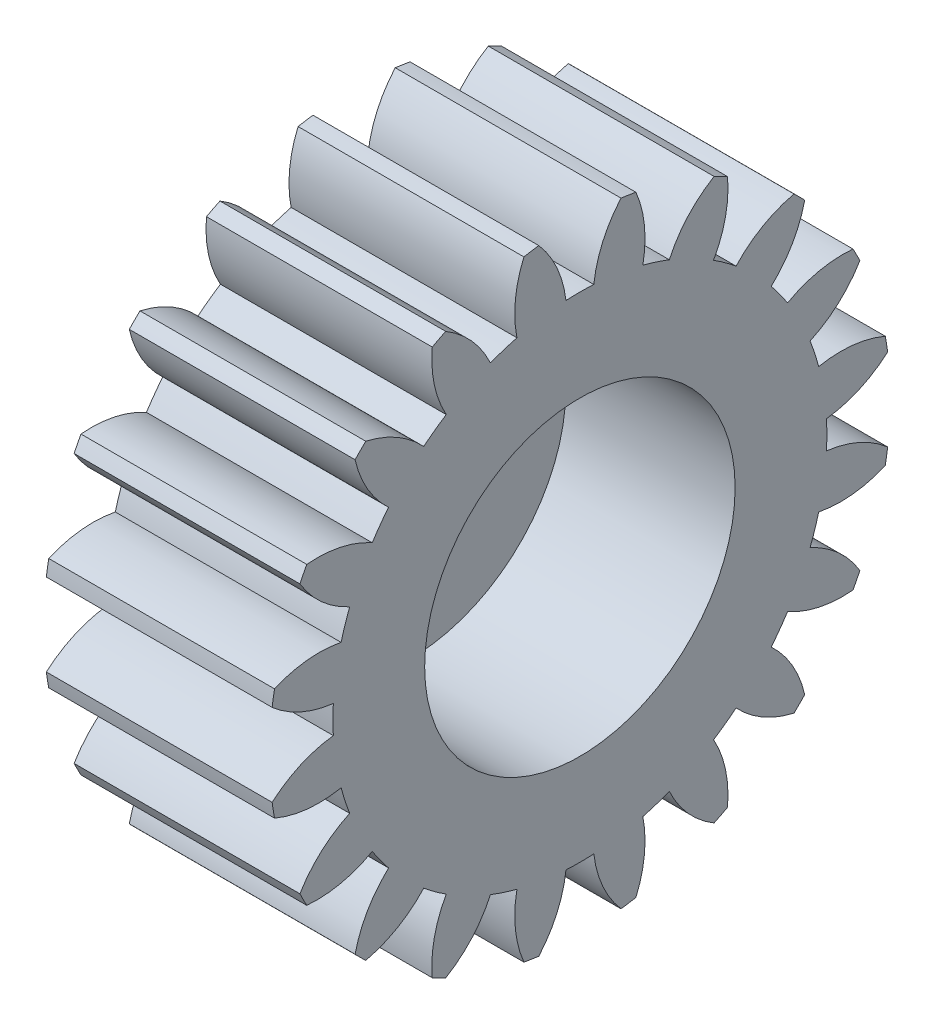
ISO-10303-21;
HEADER;
FILE_DESCRIPTION(('STEP AP214'),'2;1');
FILE_NAME('part.step','',(''),(''),'','','');
FILE_SCHEMA(('AUTOMOTIVE_DESIGN { 1 0 10303 214 1 1 1 1 }'));
ENDSEC;
DATA;
#1=APPLICATION_CONTEXT('core data for automotive mechanical design processes');
#2=APPLICATION_PROTOCOL_DEFINITION('international standard','automotive_design',2000,#1);
#3=PRODUCT_CONTEXT('',#1,'mechanical');
#4=PRODUCT('Part','Part','',(#3));
#5=PRODUCT_RELATED_PRODUCT_CATEGORY('part','',(#4));
#6=PRODUCT_DEFINITION_FORMATION('','',#4);
#7=PRODUCT_DEFINITION_CONTEXT('part definition',#1,'design');
#8=PRODUCT_DEFINITION('design','',#6,#7);
#9=PRODUCT_DEFINITION_SHAPE('','',#8);
#10=(LENGTH_UNIT() NAMED_UNIT(*) SI_UNIT(.MILLI.,.METRE.));
#11=(NAMED_UNIT(*) PLANE_ANGLE_UNIT() SI_UNIT($,.RADIAN.));
#12=(NAMED_UNIT(*) SI_UNIT($,.STERADIAN.) SOLID_ANGLE_UNIT());
#13=UNCERTAINTY_MEASURE_WITH_UNIT(LENGTH_MEASURE(1.E-05),#10,'distance_accuracy_value','');
#14=(GEOMETRIC_REPRESENTATION_CONTEXT(3) GLOBAL_UNCERTAINTY_ASSIGNED_CONTEXT((#13)) GLOBAL_UNIT_ASSIGNED_CONTEXT((#10,
#11,#12)) REPRESENTATION_CONTEXT('',''));
#15=CARTESIAN_POINT('',(0.,0.,0.));
#16=DIRECTION('',(0.,0.,1.));
#17=DIRECTION('',(1.,0.,0.));
#18=AXIS2_PLACEMENT_3D('',#15,#16,#17);
#19=CARTESIAN_POINT('',(28.5003908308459,9.50123814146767,1.53926812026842));
#20=DIRECTION('',(-1.,0.,0.));
#21=DIRECTION('',(0.,0.,1.));
#22=AXIS2_PLACEMENT_3D('',#19,#20,#21);
#23=CYLINDRICAL_SURFACE('',#22,11.);
#24=CARTESIAN_POINT('',(-5.49965996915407,9.50123814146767,1.53926812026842));
#25=DIRECTION('',(-1.,0.,0.));
#26=DIRECTION('',(0.,0.,1.));
#27=AXIS2_PLACEMENT_3D('',#24,#25,#26);
#28=CIRCLE('',#27,11.);
#29=CARTESIAN_POINT('',(-5.49965996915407,9.50123814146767,12.5392681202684));
#30=VERTEX_POINT('',#29);
#31=EDGE_CURVE('E883',#30,#30,#28,.F.);
#32=ORIENTED_EDGE('',*,*,#31,.T.);
#33=EDGE_LOOP('',(#32));
#34=FACE_BOUND('',#33,.T.);
#35=CARTESIAN_POINT('',(-17.4996599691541,9.50123814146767,1.53926812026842));
#36=DIRECTION('',(-1.,0.,0.));
#37=DIRECTION('',(0.,0.,1.));
#38=AXIS2_PLACEMENT_3D('',#35,#36,#37);
#39=CIRCLE('',#38,11.);
#40=CARTESIAN_POINT('',(-17.4996599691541,9.50123814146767,12.5392681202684));
#41=VERTEX_POINT('',#40);
#42=EDGE_CURVE('E2736',#41,#41,#39,.T.);
#43=ORIENTED_EDGE('',*,*,#42,.T.);
#44=EDGE_LOOP('',(#43));
#45=FACE_BOUND('',#44,.T.);
#46=ADVANCED_FACE('F45',(#34,#45),#23,.F.);
#47=CARTESIAN_POINT('',(-5.49965996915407,9.50123814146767,1.53926812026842));
#48=DIRECTION('',(-1.,0.,0.));
#49=DIRECTION('',(0.,0.,1.));
#50=AXIS2_PLACEMENT_3D('',#47,#48,#49);
#51=PLANE('',#50);
#52=ORIENTED_EDGE('',*,*,#31,.F.);
#53=EDGE_LOOP('',(#52));
#54=FACE_BOUND('',#53,.T.);
#55=CARTESIAN_POINT('',(-5.49965996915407,18.4325640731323,18.0752986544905));
#56=DIRECTION('',(-1.,0.,0.));
#57=DIRECTION('',(0.,1.,0.));
#58=AXIS2_PLACEMENT_3D('',#55,#56,#57);
#59=CIRCLE('',#58,8.);
#60=CARTESIAN_POINT('',(-5.49965996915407,10.4874097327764,19.0104577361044));
#61=VERTEX_POINT('',#60);
#62=CARTESIAN_POINT('',(-5.49965996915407,12.4139344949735,23.3456020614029));
#63=VERTEX_POINT('',#62);
#64=EDGE_CURVE('E583',#61,#63,#59,.T.);
#65=ORIENTED_EDGE('',*,*,#64,.F.);
#66=CARTESIAN_POINT('',(-5.49965996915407,9.50123814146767,1.53926812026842));
#67=DIRECTION('',(-1.,0.,0.));
#68=DIRECTION('',(0.,1.,0.));
#69=AXIS2_PLACEMENT_3D('',#66,#67,#68);
#70=CIRCLE('',#69,17.499);
#71=CARTESIAN_POINT('',(-5.49965996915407,8.51506655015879,19.0104577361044));
#72=VERTEX_POINT('',#71);
#73=EDGE_CURVE('E590',#72,#61,#70,.T.);
#74=ORIENTED_EDGE('',*,*,#73,.F.);
#75=CARTESIAN_POINT('',(-5.49965996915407,0.569912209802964,18.0752986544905));
#76=DIRECTION('',(-1.,0.,0.));
#77=DIRECTION('',(0.,1.,0.));
#78=AXIS2_PLACEMENT_3D('',#75,#76,#77);
#79=CIRCLE('',#78,8.);
#80=CARTESIAN_POINT('',(-5.49965996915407,6.5885417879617,23.3456020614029));
#81=VERTEX_POINT('',#80);
#82=EDGE_CURVE('E586',#81,#72,#79,.T.);
#83=ORIENTED_EDGE('',*,*,#82,.F.);
#84=CARTESIAN_POINT('',(-5.49965996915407,9.50123814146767,1.53926812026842));
#85=DIRECTION('',(-1.,0.,0.));
#86=DIRECTION('',(0.,0.,1.));
#87=AXIS2_PLACEMENT_3D('',#84,#85,#86);
#88=CIRCLE('',#87,22.);
#89=CARTESIAN_POINT('',(-5.49965996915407,5.53284921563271,23.1783967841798));
#90=VERTEX_POINT('',#89);
#91=EDGE_CURVE('E1367',#90,#81,#88,.T.);
#92=ORIENTED_EDGE('',*,*,#91,.F.);
#93=CARTESIAN_POINT('',(-5.49965996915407,12.8855194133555,20.025899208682));
#94=DIRECTION('',(-1.,0.,0.));
#95=DIRECTION('',(0.,0.951056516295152,0.309016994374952));
#96=AXIS2_PLACEMENT_3D('',#93,#94,#95);
#97=CIRCLE('',#96,8.);
#98=CARTESIAN_POINT('',(-5.49965996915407,5.04024855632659,18.4601006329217));
#99=VERTEX_POINT('',#98);
#100=EDGE_CURVE('E750',#99,#90,#97,.T.);
#101=ORIENTED_EDGE('',*,*,#100,.F.);
#102=CARTESIAN_POINT('',(-5.49965996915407,9.50123814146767,1.53926812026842));
#103=DIRECTION('',(-1.,0.,0.));
#104=DIRECTION('',(0.,0.951056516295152,0.309016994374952));
#105=AXIS2_PLACEMENT_3D('',#102,#103,#104);
#106=CIRCLE('',#105,17.499);
#107=CARTESIAN_POINT('',(-5.49965996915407,3.16443872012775,17.8506130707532));
#108=VERTEX_POINT('',#107);
#109=EDGE_CURVE('E757',#108,#99,#106,.T.);
#110=ORIENTED_EDGE('',*,*,#109,.F.);
#111=CARTESIAN_POINT('',(-5.49965996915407,-4.1028720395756,14.5060362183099));
#112=DIRECTION('',(-1.,0.,0.));
#113=DIRECTION('',(0.,0.951056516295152,0.309016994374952));
#114=AXIS2_PLACEMENT_3D('',#111,#112,#113);
#115=CIRCLE('',#114,8.);
#116=CARTESIAN_POINT('',(-5.49965996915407,-0.00742847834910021,21.3782514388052));
#117=VERTEX_POINT('',#116);
#118=EDGE_CURVE('E753',#117,#108,#115,.T.);
#119=ORIENTED_EDGE('',*,*,#118,.F.);
#120=CARTESIAN_POINT('',(-5.49965996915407,-0.959782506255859,20.8930028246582));
#121=VERTEX_POINT('',#120);
#122=EDGE_CURVE('E1345',#121,#117,#88,.T.);
#123=ORIENTED_EDGE('',*,*,#122,.F.);
#124=CARTESIAN_POINT('',(-5.49965996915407,7.00719772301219,20.1668995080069));
#125=DIRECTION('',(-1.,0.,0.));
#126=DIRECTION('',(0.,0.809016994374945,0.587785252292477));
#127=AXIS2_PLACEMENT_3D('',#124,#125,#126);
#128=CIRCLE('',#127,8.);
#129=CARTESIAN_POINT('',(-5.49965996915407,0.0297601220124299,16.2534145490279));
#130=VERTEX_POINT('',#129);
#131=EDGE_CURVE('E726',#130,#121,#128,.T.);
#132=ORIENTED_EDGE('',*,*,#131,.F.);
#133=CARTESIAN_POINT('',(-5.49965996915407,9.50123814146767,1.53926812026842));
#134=DIRECTION('',(-1.,0.,0.));
#135=DIRECTION('',(0.,0.809016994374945,0.587785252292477));
#136=AXIS2_PLACEMENT_3D('',#133,#134,#135);
#137=CIRCLE('',#136,17.499);
#138=CARTESIAN_POINT('',(-5.49965996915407,-1.56589903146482,15.0941003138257));
#139=VERTEX_POINT('',#138);
#140=EDGE_CURVE('E733',#139,#130,#137,.T.);
#141=ORIENTED_EDGE('',*,*,#140,.F.);
#142=CARTESIAN_POINT('',(-5.49965996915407,-7.44399119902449,9.66749617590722));
#143=DIRECTION('',(-1.,0.,0.));
#144=DIRECTION('',(0.,0.809016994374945,0.587785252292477));
#145=AXIS2_PLACEMENT_3D('',#142,#143,#144);
#146=CIRCLE('',#145,8.);
#147=CARTESIAN_POINT('',(-5.49965996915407,-5.67262420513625,17.4689229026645));
#148=VERTEX_POINT('',#147);
#149=EDGE_CURVE('E729',#148,#139,#146,.T.);
#150=ORIENTED_EDGE('',*,*,#149,.F.);
#151=CARTESIAN_POINT('',(-5.49965996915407,-6.4284166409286,16.7131304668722));
#152=VERTEX_POINT('',#151);
#153=EDGE_CURVE('E1489',#152,#148,#88,.T.);
#154=ORIENTED_EDGE('',*,*,#153,.F.);
#155=CARTESIAN_POINT('',(-5.49965996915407,1.3730100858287,18.4844974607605));
#156=DIRECTION('',(-1.,0.,0.));
#157=DIRECTION('',(0.,0.587785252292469,0.809016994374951));
#158=AXIS2_PLACEMENT_3D('',#155,#156,#157);
#159=CIRCLE('',#158,8.);
#160=CARTESIAN_POINT('',(-5.49965996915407,-4.05359405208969,12.6064052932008));
#161=VERTEX_POINT('',#160);
#162=EDGE_CURVE('E702',#161,#152,#159,.T.);
#163=ORIENTED_EDGE('',*,*,#162,.F.);
#164=CARTESIAN_POINT('',(-5.49965996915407,9.50123814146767,1.53926812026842));
#165=DIRECTION('',(-1.,0.,0.));
#166=DIRECTION('',(0.,0.587785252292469,0.809016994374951));
#167=AXIS2_PLACEMENT_3D('',#164,#165,#166);
#168=CIRCLE('',#167,17.499);
#169=CARTESIAN_POINT('',(-5.49965996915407,-5.21290828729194,11.0107461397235));
#170=VERTEX_POINT('',#169);
#171=EDGE_CURVE('E709',#170,#161,#168,.T.);
#172=ORIENTED_EDGE('',*,*,#171,.F.);
#173=CARTESIAN_POINT('',(-5.49965996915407,-9.12639324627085,4.03330853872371));
#174=DIRECTION('',(-1.,0.,0.));
#175=DIRECTION('',(0.,0.587785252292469,0.809016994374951));
#176=AXIS2_PLACEMENT_3D('',#173,#174,#175);
#177=CIRCLE('',#176,8.);
#178=CARTESIAN_POINT('',(-5.49965996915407,-9.85249656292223,12.0002887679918));
#179=VERTEX_POINT('',#178);
#180=EDGE_CURVE('E705',#179,#170,#177,.T.);
#181=ORIENTED_EDGE('',*,*,#180,.F.);
#182=CARTESIAN_POINT('',(-5.49965996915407,-10.3377451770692,11.047934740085));
#183=VERTEX_POINT('',#182);
#184=EDGE_CURVE('E1481',#183,#179,#88,.T.);
#185=ORIENTED_EDGE('',*,*,#184,.F.);
#186=CARTESIAN_POINT('',(-5.49965996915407,-3.46552995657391,15.1433783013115));
#187=DIRECTION('',(-1.,0.,0.));
#188=DIRECTION('',(0.,0.309016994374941,0.951056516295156));
#189=AXIS2_PLACEMENT_3D('',#186,#187,#188);
#190=CIRCLE('',#189,8.);
#191=CARTESIAN_POINT('',(-5.49965996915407,-6.8101068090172,7.87606754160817));
#192=VERTEX_POINT('',#191);
#193=EDGE_CURVE('E652',#192,#183,#190,.T.);
#194=ORIENTED_EDGE('',*,*,#193,.F.);
#195=CARTESIAN_POINT('',(-5.49965996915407,9.50123814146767,1.53926812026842));
#196=DIRECTION('',(-1.,0.,0.));
#197=DIRECTION('',(0.,0.309016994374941,0.951056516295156));
#198=AXIS2_PLACEMENT_3D('',#195,#196,#197);
#199=CIRCLE('',#198,17.499);
#200=CARTESIAN_POINT('',(-5.49965996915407,-7.41959437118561,6.00025770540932));
#201=VERTEX_POINT('',#200);
#202=EDGE_CURVE('E659',#201,#192,#199,.T.);
#203=ORIENTED_EDGE('',*,*,#202,.F.);
#204=CARTESIAN_POINT('',(-5.49965996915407,-8.98539294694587,-1.84501315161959));
#205=DIRECTION('',(-1.,0.,0.));
#206=DIRECTION('',(0.,0.309016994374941,0.951056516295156));
#207=AXIS2_PLACEMENT_3D('',#204,#205,#206);
#208=CIRCLE('',#207,8.);
#209=CARTESIAN_POINT('',(-5.49965996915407,-12.1378905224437,5.50765704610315));
#210=VERTEX_POINT('',#209);
#211=EDGE_CURVE('E655',#210,#201,#208,.T.);
#212=ORIENTED_EDGE('',*,*,#211,.F.);
#213=CARTESIAN_POINT('',(-5.49965996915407,-12.3050957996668,4.45196447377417));
#214=VERTEX_POINT('',#213);
#215=EDGE_CURVE('E1473',#214,#210,#88,.T.);
#216=ORIENTED_EDGE('',*,*,#215,.F.);
#217=CARTESIAN_POINT('',(-5.49965996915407,-7.03479239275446,10.470594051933));
#218=DIRECTION('',(-1.,0.,0.));
#219=DIRECTION('',(0.,0.,1.));
#220=AXIS2_PLACEMENT_3D('',#217,#218,#219);
#221=CIRCLE('',#220,8.);
#222=CARTESIAN_POINT('',(-5.49965996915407,-7.96995147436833,2.52543971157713));
#223=VERTEX_POINT('',#222);
#224=EDGE_CURVE('E678',#223,#214,#221,.T.);
#225=ORIENTED_EDGE('',*,*,#224,.F.);
#226=CARTESIAN_POINT('',(-5.49965996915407,9.50123814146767,1.53926812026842));
#227=DIRECTION('',(-1.,0.,0.));
#228=DIRECTION('',(0.,0.,1.));
#229=AXIS2_PLACEMENT_3D('',#226,#227,#228);
#230=CIRCLE('',#229,17.499);
#231=CARTESIAN_POINT('',(-5.49965996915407,-7.96995147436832,0.553096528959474));
#232=VERTEX_POINT('',#231);
#233=EDGE_CURVE('E685',#232,#223,#230,.T.);
#234=ORIENTED_EDGE('',*,*,#233,.F.);
#235=CARTESIAN_POINT('',(-5.49965996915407,-7.03479239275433,-7.39205781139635));
#236=DIRECTION('',(-1.,0.,0.));
#237=DIRECTION('',(0.,0.,1.));
#238=AXIS2_PLACEMENT_3D('',#235,#236,#237);
#239=CIRCLE('',#238,8.);
#240=CARTESIAN_POINT('',(-5.49965996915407,-12.3050957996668,-1.37342823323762));
#241=VERTEX_POINT('',#240);
#242=EDGE_CURVE('E681',#241,#232,#239,.T.);
#243=ORIENTED_EDGE('',*,*,#242,.F.);
#244=CARTESIAN_POINT('',(-5.49965996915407,-12.1378905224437,-2.42912080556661));
#245=VERTEX_POINT('',#244);
#246=EDGE_CURVE('E1465',#245,#241,#88,.T.);
#247=ORIENTED_EDGE('',*,*,#246,.F.);
#248=CARTESIAN_POINT('',(-5.49965996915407,-8.98539294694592,4.92354939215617));
#249=DIRECTION('',(-1.,0.,0.));
#250=DIRECTION('',(0.,-0.309016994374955,0.951056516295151));
#251=AXIS2_PLACEMENT_3D('',#248,#249,#250);
#252=CIRCLE('',#251,8.);
#253=CARTESIAN_POINT('',(-5.49965996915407,-7.41959437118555,-2.92172146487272));
#254=VERTEX_POINT('',#253);
#255=EDGE_CURVE('E846',#254,#245,#252,.T.);
#256=ORIENTED_EDGE('',*,*,#255,.F.);
#257=CARTESIAN_POINT('',(-5.49965996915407,9.50123814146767,1.53926812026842));
#258=DIRECTION('',(-1.,0.,0.));
#259=DIRECTION('',(0.,-0.309016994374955,0.951056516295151));
#260=AXIS2_PLACEMENT_3D('',#257,#258,#259);
#261=CIRCLE('',#260,17.499);
#262=CARTESIAN_POINT('',(-5.49965996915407,-6.81010680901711,-4.79753130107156));
#263=VERTEX_POINT('',#262);
#264=EDGE_CURVE('E853',#263,#254,#261,.T.);
#265=ORIENTED_EDGE('',*,*,#264,.F.);
#266=CARTESIAN_POINT('',(-5.49965996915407,-3.46552995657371,-12.0648420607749));
#267=DIRECTION('',(-1.,0.,0.));
#268=DIRECTION('',(0.,-0.309016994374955,0.951056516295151));
#269=AXIS2_PLACEMENT_3D('',#266,#267,#268);
#270=CIRCLE('',#269,8.);
#271=CARTESIAN_POINT('',(-5.49965996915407,-10.3377451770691,-7.96939849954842));
#272=VERTEX_POINT('',#271);
#273=EDGE_CURVE('E849',#272,#263,#270,.T.);
#274=ORIENTED_EDGE('',*,*,#273,.F.);
#275=CARTESIAN_POINT('',(-5.49965996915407,-9.85249656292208,-8.92175252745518));
#276=VERTEX_POINT('',#275);
#277=EDGE_CURVE('E1457',#276,#272,#88,.T.);
#278=ORIENTED_EDGE('',*,*,#277,.F.);
#279=CARTESIAN_POINT('',(-5.49965996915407,-9.12639324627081,-0.954772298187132));
#280=DIRECTION('',(-1.,0.,0.));
#281=DIRECTION('',(0.,-0.58778525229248,0.809016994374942));
#282=AXIS2_PLACEMENT_3D('',#279,#280,#281);
#283=CIRCLE('',#282,8.);
#284=CARTESIAN_POINT('',(-5.49965996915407,-5.2129082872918,-7.93220989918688));
#285=VERTEX_POINT('',#284);
#286=EDGE_CURVE('E822',#285,#276,#283,.T.);
#287=ORIENTED_EDGE('',*,*,#286,.F.);
#288=CARTESIAN_POINT('',(-5.49965996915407,9.50123814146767,1.53926812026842));
#289=DIRECTION('',(-1.,0.,0.));
#290=DIRECTION('',(0.,-0.58778525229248,0.809016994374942));
#291=AXIS2_PLACEMENT_3D('',#288,#289,#290);
#292=CIRCLE('',#291,17.499);
#293=CARTESIAN_POINT('',(-5.49965996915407,-4.05359405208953,-9.52786905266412));
#294=VERTEX_POINT('',#293);
#295=EDGE_CURVE('E829',#294,#285,#292,.T.);
#296=ORIENTED_EDGE('',*,*,#295,.F.);
#297=CARTESIAN_POINT('',(-5.49965996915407,1.37301008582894,-15.4059612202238));
#298=DIRECTION('',(-1.,0.,0.));
#299=DIRECTION('',(0.,-0.58778525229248,0.809016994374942));
#300=AXIS2_PLACEMENT_3D('',#297,#298,#299);
#301=CIRCLE('',#300,8.);
#302=CARTESIAN_POINT('',(-5.49965996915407,-6.42841664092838,-13.6345942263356));
#303=VERTEX_POINT('',#302);
#304=EDGE_CURVE('E825',#303,#294,#301,.T.);
#305=ORIENTED_EDGE('',*,*,#304,.F.);
#306=CARTESIAN_POINT('',(-5.49965996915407,-5.67262420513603,-14.3903866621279));
#307=VERTEX_POINT('',#306);
#308=EDGE_CURVE('E1449',#307,#303,#88,.T.);
#309=ORIENTED_EDGE('',*,*,#308,.F.);
#310=CARTESIAN_POINT('',(-5.49965996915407,-7.44399119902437,-6.58895993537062));
#311=DIRECTION('',(-1.,0.,0.));
#312=DIRECTION('',(0.,-0.809016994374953,0.587785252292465));
#313=AXIS2_PLACEMENT_3D('',#310,#311,#312);
#314=CIRCLE('',#313,8.);
#315=CARTESIAN_POINT('',(-5.49965996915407,-1.56589903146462,-12.015564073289));
#316=VERTEX_POINT('',#315);
#317=EDGE_CURVE('E798',#316,#307,#314,.T.);
#318=ORIENTED_EDGE('',*,*,#317,.F.);
#319=CARTESIAN_POINT('',(-5.49965996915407,9.50123814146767,1.53926812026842));
#320=DIRECTION('',(-1.,0.,0.));
#321=DIRECTION('',(0.,-0.809016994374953,0.587785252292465));
#322=AXIS2_PLACEMENT_3D('',#319,#320,#321);
#323=CIRCLE('',#322,17.499);
#324=CARTESIAN_POINT('',(-5.49965996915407,0.029760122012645,-13.1748783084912));
#325=VERTEX_POINT('',#324);
#326=EDGE_CURVE('E805',#325,#316,#323,.T.);
#327=ORIENTED_EDGE('',*,*,#326,.F.);
#328=CARTESIAN_POINT('',(-5.49965996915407,7.00719772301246,-17.0883632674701));
#329=DIRECTION('',(-1.,0.,0.));
#330=DIRECTION('',(0.,-0.809016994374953,0.587785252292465));
#331=AXIS2_PLACEMENT_3D('',#328,#329,#330);
#332=CIRCLE('',#331,8.);
#333=CARTESIAN_POINT('',(-5.49965996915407,-0.959782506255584,-17.8144665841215));
#334=VERTEX_POINT('',#333);
#335=EDGE_CURVE('E801',#334,#325,#332,.T.);
#336=ORIENTED_EDGE('',*,*,#335,.F.);
#337=CARTESIAN_POINT('',(-5.49965996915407,-0.00742847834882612,-18.2997151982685));
#338=VERTEX_POINT('',#337);
#339=EDGE_CURVE('E1441',#338,#334,#88,.T.);
#340=ORIENTED_EDGE('',*,*,#339,.F.);
#341=CARTESIAN_POINT('',(-5.49965996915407,-4.10287203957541,-11.4274999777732));
#342=DIRECTION('',(-1.,0.,0.));
#343=DIRECTION('',(0.,-0.951056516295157,0.309016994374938));
#344=AXIS2_PLACEMENT_3D('',#341,#342,#343);
#345=CIRCLE('',#344,8.);
#346=CARTESIAN_POINT('',(-5.49965996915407,3.16443872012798,-14.7720768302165));
#347=VERTEX_POINT('',#346);
#348=EDGE_CURVE('E772',#347,#338,#345,.T.);
#349=ORIENTED_EDGE('',*,*,#348,.F.);
#350=CARTESIAN_POINT('',(-5.49965996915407,9.50123814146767,1.53926812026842));
#351=DIRECTION('',(-1.,0.,0.));
#352=DIRECTION('',(0.,-0.951056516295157,0.309016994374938));
#353=AXIS2_PLACEMENT_3D('',#350,#351,#352);
#354=CIRCLE('',#353,17.499);
#355=CARTESIAN_POINT('',(-5.49965996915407,5.04024855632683,-15.3815643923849));
#356=VERTEX_POINT('',#355);
#357=EDGE_CURVE('E779',#356,#347,#354,.T.);
#358=ORIENTED_EDGE('',*,*,#357,.F.);
#359=CARTESIAN_POINT('',(-5.49965996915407,12.8855194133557,-16.9473629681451));
#360=DIRECTION('',(-1.,0.,0.));
#361=DIRECTION('',(0.,-0.951056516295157,0.309016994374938));
#362=AXIS2_PLACEMENT_3D('',#359,#360,#361);
#363=CIRCLE('',#362,8.);
#364=CARTESIAN_POINT('',(-5.49965996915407,5.53284921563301,-20.099860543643));
#365=VERTEX_POINT('',#364);
#366=EDGE_CURVE('E775',#365,#356,#363,.T.);
#367=ORIENTED_EDGE('',*,*,#366,.F.);
#368=CARTESIAN_POINT('',(-5.49965996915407,6.58854178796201,-20.2670658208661));
#369=VERTEX_POINT('',#368);
#370=EDGE_CURVE('E1433',#369,#365,#88,.T.);
#371=ORIENTED_EDGE('',*,*,#370,.F.);
#372=CARTESIAN_POINT('',(-5.49965996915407,0.569912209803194,-14.9967624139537));
#373=DIRECTION('',(-1.,0.,0.));
#374=DIRECTION('',(0.,-1.,0.));
#375=AXIS2_PLACEMENT_3D('',#372,#373,#374);
#376=CIRCLE('',#375,8.);
#377=CARTESIAN_POINT('',(-5.49965996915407,8.51506655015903,-15.9319214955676));
#378=VERTEX_POINT('',#377);
#379=EDGE_CURVE('E942',#378,#369,#376,.T.);
#380=ORIENTED_EDGE('',*,*,#379,.F.);
#381=CARTESIAN_POINT('',(-5.49965996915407,9.50123814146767,1.53926812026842));
#382=DIRECTION('',(-1.,0.,0.));
#383=DIRECTION('',(0.,-1.,0.));
#384=AXIS2_PLACEMENT_3D('',#381,#382,#383);
#385=CIRCLE('',#384,17.499);
#386=CARTESIAN_POINT('',(-5.49965996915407,10.4874097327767,-15.9319214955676));
#387=VERTEX_POINT('',#386);
#388=EDGE_CURVE('E949',#387,#378,#385,.T.);
#389=ORIENTED_EDGE('',*,*,#388,.F.);
#390=CARTESIAN_POINT('',(-5.49965996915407,18.4325640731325,-14.9967624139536));
#391=DIRECTION('',(-1.,0.,0.));
#392=DIRECTION('',(0.,-1.,0.));
#393=AXIS2_PLACEMENT_3D('',#390,#391,#392);
#394=CIRCLE('',#393,8.);
#395=CARTESIAN_POINT('',(-5.49965996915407,12.4139344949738,-20.267065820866));
#396=VERTEX_POINT('',#395);
#397=EDGE_CURVE('E945',#396,#387,#394,.T.);
#398=ORIENTED_EDGE('',*,*,#397,.F.);
#399=CARTESIAN_POINT('',(-5.49965996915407,13.4696270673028,-20.0998605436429));
#400=VERTEX_POINT('',#399);
#401=EDGE_CURVE('E1425',#400,#396,#88,.T.);
#402=ORIENTED_EDGE('',*,*,#401,.F.);
#403=CARTESIAN_POINT('',(-5.49965996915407,6.11695686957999,-16.9473629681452));
#404=DIRECTION('',(-1.,0.,0.));
#405=DIRECTION('',(0.,-0.95105651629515,-0.309016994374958));
#406=AXIS2_PLACEMENT_3D('',#403,#404,#405);
#407=CIRCLE('',#406,8.);
#408=CARTESIAN_POINT('',(-5.49965996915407,13.9622277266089,-15.3815643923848));
#409=VERTEX_POINT('',#408);
#410=EDGE_CURVE('E966',#409,#400,#407,.T.);
#411=ORIENTED_EDGE('',*,*,#410,.F.);
#412=CARTESIAN_POINT('',(-5.49965996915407,9.50123814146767,1.53926812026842));
#413=DIRECTION('',(-1.,0.,0.));
#414=DIRECTION('',(0.,-0.95105651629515,-0.309016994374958));
#415=AXIS2_PLACEMENT_3D('',#412,#413,#414);
#416=CIRCLE('',#415,17.499);
#417=CARTESIAN_POINT('',(-5.49965996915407,15.8380375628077,-14.7720768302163));
#418=VERTEX_POINT('',#417);
#419=EDGE_CURVE('E973',#418,#409,#416,.T.);
#420=ORIENTED_EDGE('',*,*,#419,.F.);
#421=CARTESIAN_POINT('',(-5.49965996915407,23.105348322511,-11.4274999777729));
#422=DIRECTION('',(-1.,0.,0.));
#423=DIRECTION('',(0.,-0.95105651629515,-0.309016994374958));
#424=AXIS2_PLACEMENT_3D('',#421,#422,#423);
#425=CIRCLE('',#424,8.);
#426=CARTESIAN_POINT('',(-5.49965996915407,19.0099047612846,-18.2997151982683));
#427=VERTEX_POINT('',#426);
#428=EDGE_CURVE('E969',#427,#418,#425,.T.);
#429=ORIENTED_EDGE('',*,*,#428,.F.);
#430=CARTESIAN_POINT('',(-5.49965996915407,19.9622587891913,-17.8144665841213));
#431=VERTEX_POINT('',#430);
#432=EDGE_CURVE('E1417',#431,#427,#88,.T.);
#433=ORIENTED_EDGE('',*,*,#432,.F.);
#434=CARTESIAN_POINT('',(-5.49965996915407,11.9952785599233,-17.0883632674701));
#435=DIRECTION('',(-1.,0.,0.));
#436=DIRECTION('',(0.,-0.80901699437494,-0.587785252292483));
#437=AXIS2_PLACEMENT_3D('',#434,#435,#436);
#438=CIRCLE('',#437,8.);
#439=CARTESIAN_POINT('',(-5.49965996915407,18.972716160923,-13.174878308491));
#440=VERTEX_POINT('',#439);
#441=EDGE_CURVE('E918',#440,#431,#438,.T.);
#442=ORIENTED_EDGE('',*,*,#441,.F.);
#443=CARTESIAN_POINT('',(-5.49965996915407,9.50123814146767,1.53926812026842));
#444=DIRECTION('',(-1.,0.,0.));
#445=DIRECTION('',(0.,-0.80901699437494,-0.587785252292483));
#446=AXIS2_PLACEMENT_3D('',#443,#444,#445);
#447=CIRCLE('',#446,17.499);
#448=CARTESIAN_POINT('',(-5.49965996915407,20.5683753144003,-12.0155640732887));
#449=VERTEX_POINT('',#448);
#450=EDGE_CURVE('E925',#449,#440,#447,.T.);
#451=ORIENTED_EDGE('',*,*,#450,.F.);
#452=CARTESIAN_POINT('',(-5.49965996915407,26.4464674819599,-6.58895993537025));
#453=DIRECTION('',(-1.,0.,0.));
#454=DIRECTION('',(0.,-0.80901699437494,-0.587785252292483));
#455=AXIS2_PLACEMENT_3D('',#452,#453,#454);
#456=CIRCLE('',#455,8.);
#457=CARTESIAN_POINT('',(-5.49965996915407,24.6751004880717,-14.3903866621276));
#458=VERTEX_POINT('',#457);
#459=EDGE_CURVE('E921',#458,#449,#456,.T.);
#460=ORIENTED_EDGE('',*,*,#459,.F.);
#461=CARTESIAN_POINT('',(-5.49965996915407,25.4308929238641,-13.6345942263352));
#462=VERTEX_POINT('',#461);
#463=EDGE_CURVE('E1409',#462,#458,#88,.T.);
#464=ORIENTED_EDGE('',*,*,#463,.F.);
#465=CARTESIAN_POINT('',(-5.49965996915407,17.6294661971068,-15.4059612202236));
#466=DIRECTION('',(-1.,0.,0.));
#467=DIRECTION('',(0.,-0.587785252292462,-0.809016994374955));
#468=AXIS2_PLACEMENT_3D('',#465,#466,#467);
#469=CIRCLE('',#468,8.);
#470=CARTESIAN_POINT('',(-5.49965996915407,23.0560703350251,-9.52786905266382));
#471=VERTEX_POINT('',#470);
#472=EDGE_CURVE('E894',#471,#462,#469,.T.);
#473=ORIENTED_EDGE('',*,*,#472,.F.);
#474=CARTESIAN_POINT('',(-5.49965996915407,9.50123814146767,1.53926812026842));
#475=DIRECTION('',(-1.,0.,0.));
#476=DIRECTION('',(0.,-0.587785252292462,-0.809016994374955));
#477=AXIS2_PLACEMENT_3D('',#474,#475,#476);
#478=CIRCLE('',#477,17.499);
#479=CARTESIAN_POINT('',(-5.49965996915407,24.2153845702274,-7.93220989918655));
#480=VERTEX_POINT('',#479);
#481=EDGE_CURVE('E901',#480,#471,#478,.T.);
#482=ORIENTED_EDGE('',*,*,#481,.F.);
#483=CARTESIAN_POINT('',(-5.49965996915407,28.1288695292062,-0.954772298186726));
#484=DIRECTION('',(-1.,0.,0.));
#485=DIRECTION('',(0.,-0.587785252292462,-0.809016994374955));
#486=AXIS2_PLACEMENT_3D('',#483,#484,#485);
#487=CIRCLE('',#486,8.);
#488=CARTESIAN_POINT('',(-5.49965996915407,28.8549728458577,-8.92175252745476));
#489=VERTEX_POINT('',#488);
#490=EDGE_CURVE('E897',#489,#480,#487,.T.);
#491=ORIENTED_EDGE('',*,*,#490,.F.);
#492=CARTESIAN_POINT('',(-5.49965996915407,29.3402214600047,-7.96939849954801));
#493=VERTEX_POINT('',#492);
#494=EDGE_CURVE('E1169',#493,#489,#88,.T.);
#495=ORIENTED_EDGE('',*,*,#494,.F.);
#496=CARTESIAN_POINT('',(-5.49965996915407,22.4680062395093,-12.0648420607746));
#497=DIRECTION('',(-1.,0.,0.));
#498=DIRECTION('',(0.,-0.309016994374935,-0.951056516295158));
#499=AXIS2_PLACEMENT_3D('',#496,#497,#498);
#500=CIRCLE('',#499,8.);
#501=CARTESIAN_POINT('',(-5.49965996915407,25.8125830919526,-4.79753130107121));
#502=VERTEX_POINT('',#501);
#503=EDGE_CURVE('E868',#502,#493,#500,.T.);
#504=ORIENTED_EDGE('',*,*,#503,.F.);
#505=CARTESIAN_POINT('',(-5.49965996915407,9.50123814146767,1.53926812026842));
#506=DIRECTION('',(-1.,0.,0.));
#507=DIRECTION('',(0.,-0.309016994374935,-0.951056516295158));
#508=AXIS2_PLACEMENT_3D('',#505,#506,#507);
#509=CIRCLE('',#508,17.499);
#510=CARTESIAN_POINT('',(-5.49965996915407,26.422070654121,-2.92172146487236));
#511=VERTEX_POINT('',#510);
#512=EDGE_CURVE('E875',#511,#502,#509,.T.);
#513=ORIENTED_EDGE('',*,*,#512,.F.);
#514=CARTESIAN_POINT('',(-5.49965996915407,27.9878692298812,4.92354939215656));
#515=DIRECTION('',(-1.,0.,0.));
#516=DIRECTION('',(0.,-0.309016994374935,-0.951056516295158));
#517=AXIS2_PLACEMENT_3D('',#514,#515,#516);
#518=CIRCLE('',#517,8.);
#519=CARTESIAN_POINT('',(-5.49965996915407,31.1403668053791,-2.42912080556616));
#520=VERTEX_POINT('',#519);
#521=EDGE_CURVE('E871',#520,#511,#518,.T.);
#522=ORIENTED_EDGE('',*,*,#521,.F.);
#523=CARTESIAN_POINT('',(-5.49965996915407,31.3075720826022,-1.37342823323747));
#524=VERTEX_POINT('',#523);
#525=EDGE_CURVE('E1164',#524,#520,#88,.T.);
#526=ORIENTED_EDGE('',*,*,#525,.F.);
#527=CARTESIAN_POINT('',(-5.49965996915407,26.0372686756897,-7.39205781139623));
#528=DIRECTION('',(-1.,0.,0.));
#529=DIRECTION('',(0.,0.,-1.));
#530=AXIS2_PLACEMENT_3D('',#527,#528,#529);
#531=CIRCLE('',#530,8.);
#532=CARTESIAN_POINT('',(-5.49965996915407,26.9724277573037,0.553096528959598));
#533=VERTEX_POINT('',#532);
#534=EDGE_CURVE('E1126',#533,#524,#531,.T.);
#535=ORIENTED_EDGE('',*,*,#534,.F.);
#536=CARTESIAN_POINT('',(-5.49965996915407,9.50123814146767,1.53926812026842));
#537=DIRECTION('',(-1.,0.,0.));
#538=DIRECTION('',(0.,0.,-1.));
#539=AXIS2_PLACEMENT_3D('',#536,#537,#538);
#540=CIRCLE('',#539,17.499);
#541=CARTESIAN_POINT('',(-5.49965996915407,26.9724277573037,2.52543971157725));
#542=VERTEX_POINT('',#541);
#543=EDGE_CURVE('E1133',#542,#533,#540,.T.);
#544=ORIENTED_EDGE('',*,*,#543,.F.);
#545=CARTESIAN_POINT('',(-5.49965996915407,26.0372686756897,10.4705940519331));
#546=DIRECTION('',(-1.,0.,0.));
#547=DIRECTION('',(0.,0.,-1.));
#548=AXIS2_PLACEMENT_3D('',#545,#546,#547);
#549=CIRCLE('',#548,8.);
#550=CARTESIAN_POINT('',(-5.49965996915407,31.3075720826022,4.45196447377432));
#551=VERTEX_POINT('',#550);
#552=EDGE_CURVE('E1129',#551,#542,#549,.T.);
#553=ORIENTED_EDGE('',*,*,#552,.F.);
#554=CARTESIAN_POINT('',(-5.49965996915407,31.1403668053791,5.50765704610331));
#555=VERTEX_POINT('',#554);
#556=EDGE_CURVE('E1161',#555,#551,#88,.T.);
#557=ORIENTED_EDGE('',*,*,#556,.F.);
#558=CARTESIAN_POINT('',(-5.49965996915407,27.9878692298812,-1.84501315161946));
#559=DIRECTION('',(-1.,0.,0.));
#560=DIRECTION('',(0.,0.309016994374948,-0.951056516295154));
#561=AXIS2_PLACEMENT_3D('',#558,#559,#560);
#562=CIRCLE('',#561,8.);
#563=CARTESIAN_POINT('',(-5.49965996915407,26.4220706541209,6.00025770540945));
#564=VERTEX_POINT('',#563);
#565=EDGE_CURVE('E1095',#564,#555,#562,.T.);
#566=ORIENTED_EDGE('',*,*,#565,.F.);
#567=CARTESIAN_POINT('',(-5.49965996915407,9.50123814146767,1.53926812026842));
#568=DIRECTION('',(-1.,0.,0.));
#569=DIRECTION('',(0.,0.309016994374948,-0.951056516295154));
#570=AXIS2_PLACEMENT_3D('',#567,#568,#569);
#571=CIRCLE('',#570,17.499);
#572=CARTESIAN_POINT('',(-5.49965996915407,25.8125830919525,7.87606754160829));
#573=VERTEX_POINT('',#572);
#574=EDGE_CURVE('E1102',#573,#564,#571,.T.);
#575=ORIENTED_EDGE('',*,*,#574,.F.);
#576=CARTESIAN_POINT('',(-5.49965996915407,22.4680062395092,15.1433783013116));
#577=DIRECTION('',(-1.,0.,0.));
#578=DIRECTION('',(0.,0.309016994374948,-0.951056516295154));
#579=AXIS2_PLACEMENT_3D('',#576,#577,#578);
#580=CIRCLE('',#579,8.);
#581=CARTESIAN_POINT('',(-5.49965996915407,29.3402214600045,11.0479347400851));
#582=VERTEX_POINT('',#581);
#583=EDGE_CURVE('E1098',#582,#573,#580,.T.);
#584=ORIENTED_EDGE('',*,*,#583,.F.);
#585=CARTESIAN_POINT('',(-5.49965996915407,28.8549728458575,12.0002887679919));
#586=VERTEX_POINT('',#585);
#587=EDGE_CURVE('E1170',#586,#582,#88,.T.);
#588=ORIENTED_EDGE('',*,*,#587,.F.);
#589=CARTESIAN_POINT('',(-5.49965996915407,28.1288695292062,4.03330853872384));
#590=DIRECTION('',(-1.,0.,0.));
#591=DIRECTION('',(0.,0.587785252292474,-0.809016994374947));
#592=AXIS2_PLACEMENT_3D('',#589,#590,#591);
#593=CIRCLE('',#592,8.);
#594=CARTESIAN_POINT('',(-5.49965996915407,24.2153845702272,11.0107461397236));
#595=VERTEX_POINT('',#594);
#596=EDGE_CURVE('E628',#595,#586,#593,.T.);
#597=ORIENTED_EDGE('',*,*,#596,.F.);
#598=CARTESIAN_POINT('',(-5.49965996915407,9.50123814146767,1.53926812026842));
#599=DIRECTION('',(-1.,0.,0.));
#600=DIRECTION('',(0.,0.587785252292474,-0.809016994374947));
#601=AXIS2_PLACEMENT_3D('',#598,#599,#600);
#602=CIRCLE('',#601,17.499);
#603=CARTESIAN_POINT('',(-5.49965996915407,23.056070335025,12.6064052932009));
#604=VERTEX_POINT('',#603);
#605=EDGE_CURVE('E635',#604,#595,#602,.T.);
#606=ORIENTED_EDGE('',*,*,#605,.F.);
#607=CARTESIAN_POINT('',(-5.49965996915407,17.6294661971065,18.4844974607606));
#608=DIRECTION('',(-1.,0.,0.));
#609=DIRECTION('',(0.,0.587785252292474,-0.809016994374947));
#610=AXIS2_PLACEMENT_3D('',#607,#608,#609);
#611=CIRCLE('',#610,8.);
#612=CARTESIAN_POINT('',(-5.49965996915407,25.4308929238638,16.7131304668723));
#613=VERTEX_POINT('',#612);
#614=EDGE_CURVE('E631',#613,#604,#611,.T.);
#615=ORIENTED_EDGE('',*,*,#614,.F.);
#616=CARTESIAN_POINT('',(-5.49965996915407,24.6751004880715,17.4689229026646));
#617=VERTEX_POINT('',#616);
#618=EDGE_CURVE('E1383',#617,#613,#88,.T.);
#619=ORIENTED_EDGE('',*,*,#618,.F.);
#620=CARTESIAN_POINT('',(-5.49965996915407,26.4464674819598,9.66749617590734));
#621=DIRECTION('',(-1.,0.,0.));
#622=DIRECTION('',(0.,0.809016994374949,-0.587785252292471));
#623=AXIS2_PLACEMENT_3D('',#620,#621,#622);
#624=CIRCLE('',#623,8.);
#625=CARTESIAN_POINT('',(-5.49965996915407,20.5683753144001,15.0941003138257));
#626=VERTEX_POINT('',#625);
#627=EDGE_CURVE('E604',#626,#617,#624,.T.);
#628=ORIENTED_EDGE('',*,*,#627,.F.);
#629=CARTESIAN_POINT('',(-5.49965996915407,9.50123814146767,1.53926812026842));
#630=DIRECTION('',(-1.,0.,0.));
#631=DIRECTION('',(0.,0.809016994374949,-0.587785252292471));
#632=AXIS2_PLACEMENT_3D('',#629,#630,#631);
#633=CIRCLE('',#632,17.499);
#634=CARTESIAN_POINT('',(-5.49965996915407,18.9727161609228,16.253414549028));
#635=VERTEX_POINT('',#634);
#636=EDGE_CURVE('E611',#635,#626,#633,.T.);
#637=ORIENTED_EDGE('',*,*,#636,.F.);
#638=CARTESIAN_POINT('',(-5.49965996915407,11.995278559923,20.1668995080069));
#639=DIRECTION('',(-1.,0.,0.));
#640=DIRECTION('',(0.,0.809016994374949,-0.587785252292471));
#641=AXIS2_PLACEMENT_3D('',#638,#639,#640);
#642=CIRCLE('',#641,8.);
#643=CARTESIAN_POINT('',(-5.49965996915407,19.9622587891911,20.8930028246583));
#644=VERTEX_POINT('',#643);
#645=EDGE_CURVE('E607',#644,#635,#642,.T.);
#646=ORIENTED_EDGE('',*,*,#645,.F.);
#647=CARTESIAN_POINT('',(-5.49965996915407,19.0099047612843,21.3782514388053));
#648=VERTEX_POINT('',#647);
#649=EDGE_CURVE('E1378',#648,#644,#88,.T.);
#650=ORIENTED_EDGE('',*,*,#649,.F.);
#651=CARTESIAN_POINT('',(-5.49965996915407,23.1053483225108,14.50603621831));
#652=DIRECTION('',(-1.,0.,0.));
#653=DIRECTION('',(0.,0.951056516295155,-0.309016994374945));
#654=AXIS2_PLACEMENT_3D('',#651,#652,#653);
#655=CIRCLE('',#654,8.);
#656=CARTESIAN_POINT('',(-5.49965996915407,15.8380375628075,17.8506130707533));
#657=VERTEX_POINT('',#656);
#658=EDGE_CURVE('E557',#657,#648,#655,.T.);
#659=ORIENTED_EDGE('',*,*,#658,.F.);
#660=CARTESIAN_POINT('',(-5.49965996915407,9.50123814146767,1.53926812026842));
#661=DIRECTION('',(-1.,0.,0.));
#662=DIRECTION('',(0.,0.951056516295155,-0.309016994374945));
#663=AXIS2_PLACEMENT_3D('',#660,#661,#662);
#664=CIRCLE('',#663,17.499);
#665=CARTESIAN_POINT('',(-5.49965996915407,13.9622277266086,18.4601006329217));
#666=VERTEX_POINT('',#665);
#667=EDGE_CURVE('E556',#666,#657,#664,.T.);
#668=ORIENTED_EDGE('',*,*,#667,.F.);
#669=CARTESIAN_POINT('',(-5.49965996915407,6.11695686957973,20.025899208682));
#670=DIRECTION('',(-1.,0.,0.));
#671=DIRECTION('',(0.,0.951056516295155,-0.309016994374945));
#672=AXIS2_PLACEMENT_3D('',#669,#670,#671);
#673=CIRCLE('',#672,8.);
#674=CARTESIAN_POINT('',(-5.49965996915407,13.4696270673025,23.1783967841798));
#675=VERTEX_POINT('',#674);
#676=EDGE_CURVE('E544',#675,#666,#673,.T.);
#677=ORIENTED_EDGE('',*,*,#676,.F.);
#678=EDGE_CURVE('E1235',#63,#675,#88,.T.);
#679=ORIENTED_EDGE('',*,*,#678,.F.);
#680=EDGE_LOOP('',(#65,#74,#83,#92,#101,#110,#119,#123,#132,#141,#150,#154,#163,#172,#181,#185,
#194,#203,#212,#216,#225,#234,#243,#247,#256,#265,#274,#278,#287,#296,#305,#309,#318,#327,#336,
#340,#349,#358,#367,#371,#380,#389,#398,#402,#411,#420,#429,#433,#442,#451,#460,#464,#473,#482,
#491,#495,#504,#513,#522,#526,#535,#544,#553,#557,#566,#575,#584,#588,#597,#606,#615,#619,#628,
#637,#646,#650,#659,#668,#677,#679));
#681=FACE_BOUND('',#680,.T.);
#682=ADVANCED_FACE('F47',(#54,#681),#51,.F.);
#683=CARTESIAN_POINT('',(-31.4996599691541,9.50123814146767,1.53926812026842));
#684=DIRECTION('',(-1.,0.,0.));
#685=DIRECTION('',(0.,0.,1.));
#686=AXIS2_PLACEMENT_3D('',#683,#684,#685);
#687=CYLINDRICAL_SURFACE('',#686,22.);
#688=DIRECTION('',(-1.,0.,0.));
#689=VECTOR('',#688,1.);
#690=CARTESIAN_POINT('',(-13.4996599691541,12.4139344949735,23.3456020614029));
#691=LINE('',#690,#689);
#692=CARTESIAN_POINT('',(-21.4996599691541,12.4139344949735,23.3456020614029));
#693=VERTEX_POINT('',#692);
#694=EDGE_CURVE('E1091',#63,#693,#691,.T.);
#695=ORIENTED_EDGE('',*,*,#694,.F.);
#696=ORIENTED_EDGE('',*,*,#678,.T.);
#697=DIRECTION('',(-1.,0.,0.));
#698=VECTOR('',#697,1.);
#699=CARTESIAN_POINT('',(-13.4996599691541,13.4696270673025,23.1783967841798));
#700=LINE('',#699,#698);
#701=CARTESIAN_POINT('',(-21.4996599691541,13.4696270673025,23.1783967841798));
#702=VERTEX_POINT('',#701);
#703=EDGE_CURVE('E550',#702,#675,#700,.F.);
#704=ORIENTED_EDGE('',*,*,#703,.F.);
#705=CARTESIAN_POINT('',(-21.4996599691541,9.50123814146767,1.53926812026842));
#706=DIRECTION('',(-1.,0.,0.));
#707=DIRECTION('',(0.,0.,1.));
#708=AXIS2_PLACEMENT_3D('',#705,#706,#707);
#709=CIRCLE('',#708,22.);
#710=EDGE_CURVE('E1234',#693,#702,#709,.T.);
#711=ORIENTED_EDGE('',*,*,#710,.F.);
#712=EDGE_LOOP('',(#695,#696,#704,#711));
#713=FACE_BOUND('',#712,.T.);
#714=ADVANCED_FACE('F1233',(#713),#687,.T.);
#715=DIRECTION('',(-1.,0.,0.));
#716=VECTOR('',#715,1.);
#717=CARTESIAN_POINT('',(-13.4996599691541,6.5885417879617,23.3456020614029));
#718=LINE('',#717,#716);
#719=CARTESIAN_POINT('',(-21.4996599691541,6.5885417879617,23.3456020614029));
#720=VERTEX_POINT('',#719);
#721=EDGE_CURVE('E1088',#720,#81,#718,.F.);
#722=ORIENTED_EDGE('',*,*,#721,.F.);
#723=CARTESIAN_POINT('',(-21.4996599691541,5.53284921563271,23.1783967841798));
#724=VERTEX_POINT('',#723);
#725=EDGE_CURVE('E1238',#724,#720,#709,.T.);
#726=ORIENTED_EDGE('',*,*,#725,.F.);
#727=DIRECTION('',(-1.,0.,0.));
#728=VECTOR('',#727,1.);
#729=CARTESIAN_POINT('',(-13.4996599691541,5.53284921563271,23.1783967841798));
#730=LINE('',#729,#728);
#731=EDGE_CURVE('E1050',#90,#724,#730,.T.);
#732=ORIENTED_EDGE('',*,*,#731,.F.);
#733=ORIENTED_EDGE('',*,*,#91,.T.);
#734=EDGE_LOOP('',(#722,#726,#732,#733));
#735=FACE_BOUND('',#734,.T.);
#736=ADVANCED_FACE('F1365',(#735),#687,.T.);
#737=DIRECTION('',(-1.,0.,0.));
#738=VECTOR('',#737,1.);
#739=CARTESIAN_POINT('',(-13.4996599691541,19.0099047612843,21.3782514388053));
#740=LINE('',#739,#738);
#741=CARTESIAN_POINT('',(-21.4996599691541,19.0099047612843,21.3782514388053));
#742=VERTEX_POINT('',#741);
#743=EDGE_CURVE('E1085',#648,#742,#740,.T.);
#744=ORIENTED_EDGE('',*,*,#743,.F.);
#745=ORIENTED_EDGE('',*,*,#649,.T.);
#746=DIRECTION('',(-1.,0.,0.));
#747=VECTOR('',#746,1.);
#748=CARTESIAN_POINT('',(-13.4996599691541,19.9622587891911,20.8930028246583));
#749=LINE('',#748,#747);
#750=CARTESIAN_POINT('',(-21.4996599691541,19.9622587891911,20.8930028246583));
#751=VERTEX_POINT('',#750);
#752=EDGE_CURVE('E1071',#751,#644,#749,.F.);
#753=ORIENTED_EDGE('',*,*,#752,.F.);
#754=EDGE_CURVE('E1239',#742,#751,#709,.T.);
#755=ORIENTED_EDGE('',*,*,#754,.F.);
#756=EDGE_LOOP('',(#744,#745,#753,#755));
#757=FACE_BOUND('',#756,.T.);
#758=ADVANCED_FACE('F1837',(#757),#687,.T.);
#759=DIRECTION('',(-1.,0.,0.));
#760=VECTOR('',#759,1.);
#761=CARTESIAN_POINT('',(-13.4996599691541,28.8549728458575,12.0002887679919));
#762=LINE('',#761,#760);
#763=CARTESIAN_POINT('',(-21.4996599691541,28.8549728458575,12.0002887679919));
#764=VERTEX_POINT('',#763);
#765=EDGE_CURVE('E1080',#586,#764,#762,.T.);
#766=ORIENTED_EDGE('',*,*,#765,.F.);
#767=ORIENTED_EDGE('',*,*,#587,.T.);
#768=DIRECTION('',(-1.,0.,0.));
#769=VECTOR('',#768,1.);
#770=CARTESIAN_POINT('',(-13.4996599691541,29.3402214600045,11.0479347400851));
#771=LINE('',#770,#769);
#772=CARTESIAN_POINT('',(-21.4996599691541,29.3402214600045,11.0479347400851));
#773=VERTEX_POINT('',#772);
#774=EDGE_CURVE('E1118',#773,#582,#771,.F.);
#775=ORIENTED_EDGE('',*,*,#774,.F.);
#776=EDGE_CURVE('E1163',#764,#773,#709,.T.);
#777=ORIENTED_EDGE('',*,*,#776,.F.);
#778=EDGE_LOOP('',(#766,#767,#775,#777));
#779=FACE_BOUND('',#778,.T.);
#780=ADVANCED_FACE('F1833',(#779),#687,.T.);
#781=DIRECTION('',(-1.,0.,0.));
#782=VECTOR('',#781,1.);
#783=CARTESIAN_POINT('',(-13.4996599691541,25.4308929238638,16.7131304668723));
#784=LINE('',#783,#782);
#785=CARTESIAN_POINT('',(-21.4996599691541,25.4308929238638,16.7131304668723));
#786=VERTEX_POINT('',#785);
#787=EDGE_CURVE('E1077',#786,#613,#784,.F.);
#788=ORIENTED_EDGE('',*,*,#787,.F.);
#789=CARTESIAN_POINT('',(-21.4996599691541,24.6751004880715,17.4689229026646));
#790=VERTEX_POINT('',#789);
#791=EDGE_CURVE('E1246',#790,#786,#709,.T.);
#792=ORIENTED_EDGE('',*,*,#791,.F.);
#793=DIRECTION('',(-1.,0.,0.));
#794=VECTOR('',#793,1.);
#795=CARTESIAN_POINT('',(-13.4996599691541,24.6751004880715,17.4689229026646));
#796=LINE('',#795,#794);
#797=EDGE_CURVE('E1074',#617,#790,#796,.T.);
#798=ORIENTED_EDGE('',*,*,#797,.F.);
#799=ORIENTED_EDGE('',*,*,#618,.T.);
#800=EDGE_LOOP('',(#788,#792,#798,#799));
#801=FACE_BOUND('',#800,.T.);
#802=ADVANCED_FACE('F1829',(#801),#687,.T.);
#803=DIRECTION('',(-1.,0.,0.));
#804=VECTOR('',#803,1.);
#805=CARTESIAN_POINT('',(-13.4996599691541,-6.4284166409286,16.7131304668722));
#806=LINE('',#805,#804);
#807=CARTESIAN_POINT('',(-21.4996599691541,-6.4284166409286,16.7131304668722));
#808=VERTEX_POINT('',#807);
#809=EDGE_CURVE('E1068',#152,#808,#806,.T.);
#810=ORIENTED_EDGE('',*,*,#809,.F.);
#811=ORIENTED_EDGE('',*,*,#153,.T.);
#812=DIRECTION('',(-1.,0.,0.));
#813=VECTOR('',#812,1.);
#814=CARTESIAN_POINT('',(-13.4996599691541,-5.67262420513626,17.4689229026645));
#815=LINE('',#814,#813);
#816=CARTESIAN_POINT('',(-21.4996599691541,-5.67262420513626,17.4689229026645));
#817=VERTEX_POINT('',#816);
#818=EDGE_CURVE('E1041',#817,#148,#815,.F.);
#819=ORIENTED_EDGE('',*,*,#818,.F.);
#820=EDGE_CURVE('E1325',#808,#817,#709,.T.);
#821=ORIENTED_EDGE('',*,*,#820,.F.);
#822=EDGE_LOOP('',(#810,#811,#819,#821));
#823=FACE_BOUND('',#822,.T.);
#824=ADVANCED_FACE('F1505',(#823),#687,.T.);
#825=DIRECTION('',(-1.,0.,0.));
#826=VECTOR('',#825,1.);
#827=CARTESIAN_POINT('',(-13.4996599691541,-9.85249656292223,12.0002887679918));
#828=LINE('',#827,#826);
#829=CARTESIAN_POINT('',(-21.4996599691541,-9.85249656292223,12.0002887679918));
#830=VERTEX_POINT('',#829);
#831=EDGE_CURVE('E1065',#830,#179,#828,.F.);
#832=ORIENTED_EDGE('',*,*,#831,.F.);
#833=CARTESIAN_POINT('',(-21.4996599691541,-10.3377451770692,11.047934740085));
#834=VERTEX_POINT('',#833);
#835=EDGE_CURVE('E1319',#834,#830,#709,.T.);
#836=ORIENTED_EDGE('',*,*,#835,.F.);
#837=DIRECTION('',(-1.,0.,0.));
#838=VECTOR('',#837,1.);
#839=CARTESIAN_POINT('',(-13.4996599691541,-10.3377451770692,11.047934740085));
#840=LINE('',#839,#838);
#841=EDGE_CURVE('E1062',#183,#834,#840,.T.);
#842=ORIENTED_EDGE('',*,*,#841,.F.);
#843=ORIENTED_EDGE('',*,*,#184,.T.);
#844=EDGE_LOOP('',(#832,#836,#842,#843));
#845=FACE_BOUND('',#844,.T.);
#846=ADVANCED_FACE('F1819',(#845),#687,.T.);
#847=DIRECTION('',(-1.,0.,0.));
#848=VECTOR('',#847,1.);
#849=CARTESIAN_POINT('',(-13.4996599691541,-12.1378905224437,5.50765704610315));
#850=LINE('',#849,#848);
#851=CARTESIAN_POINT('',(-21.4996599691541,-12.1378905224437,5.50765704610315));
#852=VERTEX_POINT('',#851);
#853=EDGE_CURVE('E1059',#852,#210,#850,.F.);
#854=ORIENTED_EDGE('',*,*,#853,.F.);
#855=CARTESIAN_POINT('',(-21.4996599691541,-12.3050957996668,4.45196447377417));
#856=VERTEX_POINT('',#855);
#857=EDGE_CURVE('E1313',#856,#852,#709,.T.);
#858=ORIENTED_EDGE('',*,*,#857,.F.);
#859=DIRECTION('',(-1.,0.,0.));
#860=VECTOR('',#859,1.);
#861=CARTESIAN_POINT('',(-13.4996599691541,-12.3050957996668,4.45196447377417));
#862=LINE('',#861,#860);
#863=EDGE_CURVE('E1056',#214,#856,#862,.T.);
#864=ORIENTED_EDGE('',*,*,#863,.F.);
#865=ORIENTED_EDGE('',*,*,#215,.T.);
#866=EDGE_LOOP('',(#854,#858,#864,#865));
#867=FACE_BOUND('',#866,.T.);
#868=ADVANCED_FACE('F1812',(#867),#687,.T.);
#869=DIRECTION('',(-1.,0.,0.));
#870=VECTOR('',#869,1.);
#871=CARTESIAN_POINT('',(-13.4996599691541,-12.3050957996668,-1.37342823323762));
#872=LINE('',#871,#870);
#873=CARTESIAN_POINT('',(-21.4996599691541,-12.3050957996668,-1.37342823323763));
#874=VERTEX_POINT('',#873);
#875=EDGE_CURVE('E1053',#874,#241,#872,.F.);
#876=ORIENTED_EDGE('',*,*,#875,.F.);
#877=CARTESIAN_POINT('',(-21.4996599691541,-12.1378905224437,-2.42912080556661));
#878=VERTEX_POINT('',#877);
#879=EDGE_CURVE('E1307',#878,#874,#709,.T.);
#880=ORIENTED_EDGE('',*,*,#879,.F.);
#881=DIRECTION('',(-1.,0.,0.));
#882=VECTOR('',#881,1.);
#883=CARTESIAN_POINT('',(-13.4996599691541,-12.1378905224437,-2.42912080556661));
#884=LINE('',#883,#882);
#885=EDGE_CURVE('E1026',#245,#878,#884,.T.);
#886=ORIENTED_EDGE('',*,*,#885,.F.);
#887=ORIENTED_EDGE('',*,*,#246,.T.);
#888=EDGE_LOOP('',(#876,#880,#886,#887));
#889=FACE_BOUND('',#888,.T.);
#890=ADVANCED_FACE('F1805',(#889),#687,.T.);
#891=DIRECTION('',(-1.,0.,0.));
#892=VECTOR('',#891,1.);
#893=CARTESIAN_POINT('',(-13.4996599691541,-0.00742847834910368,21.3782514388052));
#894=LINE('',#893,#892);
#895=CARTESIAN_POINT('',(-21.4996599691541,-0.00742847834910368,21.3782514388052));
#896=VERTEX_POINT('',#895);
#897=EDGE_CURVE('E1047',#896,#117,#894,.F.);
#898=ORIENTED_EDGE('',*,*,#897,.F.);
#899=CARTESIAN_POINT('',(-21.4996599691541,-0.959782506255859,20.8930028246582));
#900=VERTEX_POINT('',#899);
#901=EDGE_CURVE('E1244',#900,#896,#709,.T.);
#902=ORIENTED_EDGE('',*,*,#901,.F.);
#903=DIRECTION('',(-1.,0.,0.));
#904=VECTOR('',#903,1.);
#905=CARTESIAN_POINT('',(-13.4996599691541,-0.959782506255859,20.8930028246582));
#906=LINE('',#905,#904);
#907=EDGE_CURVE('E1044',#121,#900,#906,.T.);
#908=ORIENTED_EDGE('',*,*,#907,.F.);
#909=ORIENTED_EDGE('',*,*,#122,.T.);
#910=EDGE_LOOP('',(#898,#902,#908,#909));
#911=FACE_BOUND('',#910,.T.);
#912=ADVANCED_FACE('F1342',(#911),#687,.T.);
#913=DIRECTION('',(-1.,0.,0.));
#914=VECTOR('',#913,1.);
#915=CARTESIAN_POINT('',(-13.4996599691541,-5.67262420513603,-14.3903866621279));
#916=LINE('',#915,#914);
#917=CARTESIAN_POINT('',(-21.4996599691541,-5.67262420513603,-14.3903866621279));
#918=VERTEX_POINT('',#917);
#919=EDGE_CURVE('E1038',#307,#918,#916,.T.);
#920=ORIENTED_EDGE('',*,*,#919,.F.);
#921=ORIENTED_EDGE('',*,*,#308,.T.);
#922=DIRECTION('',(-1.,0.,0.));
#923=VECTOR('',#922,1.);
#924=CARTESIAN_POINT('',(-13.4996599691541,-6.42841664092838,-13.6345942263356));
#925=LINE('',#924,#923);
#926=CARTESIAN_POINT('',(-21.4996599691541,-6.42841664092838,-13.6345942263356));
#927=VERTEX_POINT('',#926);
#928=EDGE_CURVE('E1017',#927,#303,#925,.F.);
#929=ORIENTED_EDGE('',*,*,#928,.F.);
#930=EDGE_CURVE('E1295',#918,#927,#709,.T.);
#931=ORIENTED_EDGE('',*,*,#930,.F.);
#932=EDGE_LOOP('',(#920,#921,#929,#931));
#933=FACE_BOUND('',#932,.T.);
#934=ADVANCED_FACE('F1791',(#933),#687,.T.);
#935=DIRECTION('',(-1.,0.,0.));
#936=VECTOR('',#935,1.);
#937=CARTESIAN_POINT('',(-13.4996599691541,-0.959782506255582,-17.8144665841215));
#938=LINE('',#937,#936);
#939=CARTESIAN_POINT('',(-21.4996599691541,-0.959782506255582,-17.8144665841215));
#940=VERTEX_POINT('',#939);
#941=EDGE_CURVE('E1035',#940,#334,#938,.F.);
#942=ORIENTED_EDGE('',*,*,#941,.F.);
#943=CARTESIAN_POINT('',(-21.4996599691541,-0.00742847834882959,-18.2997151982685));
#944=VERTEX_POINT('',#943);
#945=EDGE_CURVE('E1289',#944,#940,#709,.T.);
#946=ORIENTED_EDGE('',*,*,#945,.F.);
#947=DIRECTION('',(-1.,0.,0.));
#948=VECTOR('',#947,1.);
#949=CARTESIAN_POINT('',(-13.4996599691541,-0.00742847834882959,-18.2997151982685));
#950=LINE('',#949,#948);
#951=EDGE_CURVE('E1032',#338,#944,#950,.T.);
#952=ORIENTED_EDGE('',*,*,#951,.F.);
#953=ORIENTED_EDGE('',*,*,#339,.T.);
#954=EDGE_LOOP('',(#942,#946,#952,#953));
#955=FACE_BOUND('',#954,.T.);
#956=ADVANCED_FACE('F1784',(#955),#687,.T.);
#957=DIRECTION('',(-1.,0.,0.));
#958=VECTOR('',#957,1.);
#959=CARTESIAN_POINT('',(-13.4996599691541,5.53284921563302,-20.099860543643));
#960=LINE('',#959,#958);
#961=CARTESIAN_POINT('',(-21.4996599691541,5.53284921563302,-20.099860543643));
#962=VERTEX_POINT('',#961);
#963=EDGE_CURVE('E1029',#962,#365,#960,.F.);
#964=ORIENTED_EDGE('',*,*,#963,.F.);
#965=CARTESIAN_POINT('',(-21.4996599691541,6.58854178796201,-20.2670658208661));
#966=VERTEX_POINT('',#965);
#967=EDGE_CURVE('E1283',#966,#962,#709,.T.);
#968=ORIENTED_EDGE('',*,*,#967,.F.);
#969=DIRECTION('',(-1.,0.,0.));
#970=VECTOR('',#969,1.);
#971=CARTESIAN_POINT('',(-13.4996599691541,6.58854178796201,-20.2670658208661));
#972=LINE('',#971,#970);
#973=EDGE_CURVE('E990',#369,#966,#972,.T.);
#974=ORIENTED_EDGE('',*,*,#973,.F.);
#975=ORIENTED_EDGE('',*,*,#370,.T.);
#976=EDGE_LOOP('',(#964,#968,#974,#975));
#977=FACE_BOUND('',#976,.T.);
#978=ADVANCED_FACE('F1777',(#977),#687,.T.);
#979=DIRECTION('',(-1.,0.,0.));
#980=VECTOR('',#979,1.);
#981=CARTESIAN_POINT('',(-13.4996599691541,-10.3377451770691,-7.96939849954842));
#982=LINE('',#981,#980);
#983=CARTESIAN_POINT('',(-21.4996599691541,-10.3377451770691,-7.96939849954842));
#984=VERTEX_POINT('',#983);
#985=EDGE_CURVE('E1023',#984,#272,#982,.F.);
#986=ORIENTED_EDGE('',*,*,#985,.F.);
#987=CARTESIAN_POINT('',(-21.4996599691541,-9.85249656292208,-8.92175252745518));
#988=VERTEX_POINT('',#987);
#989=EDGE_CURVE('E1301',#988,#984,#709,.T.);
#990=ORIENTED_EDGE('',*,*,#989,.F.);
#991=DIRECTION('',(-1.,0.,0.));
#992=VECTOR('',#991,1.);
#993=CARTESIAN_POINT('',(-13.4996599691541,-9.85249656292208,-8.92175252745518));
#994=LINE('',#993,#992);
#995=EDGE_CURVE('E1020',#276,#988,#994,.T.);
#996=ORIENTED_EDGE('',*,*,#995,.F.);
#997=ORIENTED_EDGE('',*,*,#277,.T.);
#998=EDGE_LOOP('',(#986,#990,#996,#997));
#999=FACE_BOUND('',#998,.T.);
#1000=ADVANCED_FACE('F1798',(#999),#687,.T.);
#1001=DIRECTION('',(-1.,0.,0.));
#1002=VECTOR('',#1001,1.);
#1003=CARTESIAN_POINT('',(-13.4996599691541,19.9622587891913,-17.8144665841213));
#1004=LINE('',#1003,#1002);
#1005=CARTESIAN_POINT('',(-21.4996599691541,19.9622587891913,-17.8144665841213));
#1006=VERTEX_POINT('',#1005);
#1007=EDGE_CURVE('E1014',#431,#1006,#1004,.T.);
#1008=ORIENTED_EDGE('',*,*,#1007,.F.);
#1009=ORIENTED_EDGE('',*,*,#432,.T.);
#1010=DIRECTION('',(-1.,0.,0.));
#1011=VECTOR('',#1010,1.);
#1012=CARTESIAN_POINT('',(-13.4996599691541,19.0099047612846,-18.2997151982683));
#1013=LINE('',#1012,#1011);
#1014=CARTESIAN_POINT('',(-21.4996599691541,19.0099047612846,-18.2997151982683));
#1015=VERTEX_POINT('',#1014);
#1016=EDGE_CURVE('E993',#1015,#427,#1013,.F.);
#1017=ORIENTED_EDGE('',*,*,#1016,.F.);
#1018=EDGE_CURVE('E1271',#1006,#1015,#709,.T.);
#1019=ORIENTED_EDGE('',*,*,#1018,.F.);
#1020=EDGE_LOOP('',(#1008,#1009,#1017,#1019));
#1021=FACE_BOUND('',#1020,.T.);
#1022=ADVANCED_FACE('F1881',(#1021),#687,.T.);
#1023=DIRECTION('',(-1.,0.,0.));
#1024=VECTOR('',#1023,1.);
#1025=CARTESIAN_POINT('',(-13.4996599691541,24.6751004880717,-14.3903866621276));
#1026=LINE('',#1025,#1024);
#1027=CARTESIAN_POINT('',(-21.4996599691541,24.6751004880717,-14.3903866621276));
#1028=VERTEX_POINT('',#1027);
#1029=EDGE_CURVE('E1011',#1028,#458,#1026,.F.);
#1030=ORIENTED_EDGE('',*,*,#1029,.F.);
#1031=CARTESIAN_POINT('',(-21.4996599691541,25.4308929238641,-13.6345942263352));
#1032=VERTEX_POINT('',#1031);
#1033=EDGE_CURVE('E1265',#1032,#1028,#709,.T.);
#1034=ORIENTED_EDGE('',*,*,#1033,.F.);
#1035=DIRECTION('',(-1.,0.,0.));
#1036=VECTOR('',#1035,1.);
#1037=CARTESIAN_POINT('',(-13.4996599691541,25.4308929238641,-13.6345942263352));
#1038=LINE('',#1037,#1036);
#1039=EDGE_CURVE('E1002',#462,#1032,#1038,.T.);
#1040=ORIENTED_EDGE('',*,*,#1039,.F.);
#1041=ORIENTED_EDGE('',*,*,#463,.T.);
#1042=EDGE_LOOP('',(#1030,#1034,#1040,#1041));
#1043=FACE_BOUND('',#1042,.T.);
#1044=ADVANCED_FACE('F1874',(#1043),#687,.T.);
#1045=DIRECTION('',(-1.,0.,0.));
#1046=VECTOR('',#1045,1.);
#1047=CARTESIAN_POINT('',(-13.4996599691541,29.3402214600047,-7.96939849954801));
#1048=LINE('',#1047,#1046);
#1049=CARTESIAN_POINT('',(-21.4996599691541,29.3402214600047,-7.96939849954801));
#1050=VERTEX_POINT('',#1049);
#1051=EDGE_CURVE('E1008',#493,#1050,#1048,.T.);
#1052=ORIENTED_EDGE('',*,*,#1051,.F.);
#1053=ORIENTED_EDGE('',*,*,#494,.T.);
#1054=DIRECTION('',(-1.,0.,0.));
#1055=VECTOR('',#1054,1.);
#1056=CARTESIAN_POINT('',(-13.4996599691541,28.8549728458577,-8.92175252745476));
#1057=LINE('',#1056,#1055);
#1058=CARTESIAN_POINT('',(-21.4996599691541,28.8549728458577,-8.92175252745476));
#1059=VERTEX_POINT('',#1058);
#1060=EDGE_CURVE('E999',#1059,#489,#1057,.F.);
#1061=ORIENTED_EDGE('',*,*,#1060,.F.);
#1062=EDGE_CURVE('E1162',#1050,#1059,#709,.T.);
#1063=ORIENTED_EDGE('',*,*,#1062,.F.);
#1064=EDGE_LOOP('',(#1052,#1053,#1061,#1063));
#1065=FACE_BOUND('',#1064,.T.);
#1066=ADVANCED_FACE('F1767',(#1065),#687,.T.);
#1067=DIRECTION('',(-1.,0.,0.));
#1068=VECTOR('',#1067,1.);
#1069=CARTESIAN_POINT('',(-13.4996599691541,31.1403668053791,-2.42912080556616));
#1070=LINE('',#1069,#1068);
#1071=CARTESIAN_POINT('',(-21.4996599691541,31.1403668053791,-2.42912080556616));
#1072=VERTEX_POINT('',#1071);
#1073=EDGE_CURVE('E1005',#1072,#520,#1070,.F.);
#1074=ORIENTED_EDGE('',*,*,#1073,.F.);
#1075=CARTESIAN_POINT('',(-21.4996599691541,31.3075720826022,-1.37342823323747));
#1076=VERTEX_POINT('',#1075);
#1077=EDGE_CURVE('E1157',#1076,#1072,#709,.T.);
#1078=ORIENTED_EDGE('',*,*,#1077,.F.);
#1079=DIRECTION('',(-1.,0.,0.));
#1080=VECTOR('',#1079,1.);
#1081=CARTESIAN_POINT('',(-13.4996599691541,31.3075720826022,-1.37342823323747));
#1082=LINE('',#1081,#1080);
#1083=EDGE_CURVE('E1153',#524,#1076,#1082,.T.);
#1084=ORIENTED_EDGE('',*,*,#1083,.F.);
#1085=ORIENTED_EDGE('',*,*,#525,.T.);
#1086=EDGE_LOOP('',(#1074,#1078,#1084,#1085));
#1087=FACE_BOUND('',#1086,.T.);
#1088=ADVANCED_FACE('F1763',(#1087),#687,.T.);
#1089=DIRECTION('',(-1.,0.,0.));
#1090=VECTOR('',#1089,1.);
#1091=CARTESIAN_POINT('',(-13.4996599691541,13.4696270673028,-20.0998605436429));
#1092=LINE('',#1091,#1090);
#1093=CARTESIAN_POINT('',(-21.4996599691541,13.4696270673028,-20.0998605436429));
#1094=VERTEX_POINT('',#1093);
#1095=EDGE_CURVE('E996',#400,#1094,#1092,.T.);
#1096=ORIENTED_EDGE('',*,*,#1095,.F.);
#1097=ORIENTED_EDGE('',*,*,#401,.T.);
#1098=DIRECTION('',(-1.,0.,0.));
#1099=VECTOR('',#1098,1.);
#1100=CARTESIAN_POINT('',(-13.4996599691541,12.4139344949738,-20.267065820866));
#1101=LINE('',#1100,#1099);
#1102=CARTESIAN_POINT('',(-21.4996599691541,12.4139344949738,-20.267065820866));
#1103=VERTEX_POINT('',#1102);
#1104=EDGE_CURVE('E651',#1103,#396,#1101,.F.);
#1105=ORIENTED_EDGE('',*,*,#1104,.F.);
#1106=EDGE_CURVE('E1277',#1094,#1103,#709,.T.);
#1107=ORIENTED_EDGE('',*,*,#1106,.F.);
#1108=EDGE_LOOP('',(#1096,#1097,#1105,#1107));
#1109=FACE_BOUND('',#1108,.T.);
#1110=ADVANCED_FACE('F1756',(#1109),#687,.T.);
#1111=CARTESIAN_POINT('',(-21.4996599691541,9.50123814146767,1.53926812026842));
#1112=DIRECTION('',(1.,0.,0.));
#1113=DIRECTION('',(0.,0.,-1.));
#1114=AXIS2_PLACEMENT_3D('',#1111,#1112,#1113);
#1115=PLANE('',#1114);
#1116=CARTESIAN_POINT('',(-21.4996599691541,9.50123814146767,1.53926812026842));
#1117=DIRECTION('',(-1.,0.,0.));
#1118=DIRECTION('',(0.,0.,1.));
#1119=AXIS2_PLACEMENT_3D('',#1116,#1117,#1118);
#1120=CIRCLE('',#1119,2.5);
#1121=CARTESIAN_POINT('',(-21.4996599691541,9.50123814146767,4.03926812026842));
#1122=VERTEX_POINT('',#1121);
#1123=EDGE_CURVE('E2732',#1122,#1122,#1120,.T.);
#1124=ORIENTED_EDGE('',*,*,#1123,.F.);
#1125=EDGE_LOOP('',(#1124));
#1126=FACE_BOUND('',#1125,.T.);
#1127=CARTESIAN_POINT('',(-21.4996599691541,18.4325640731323,18.0752986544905));
#1128=DIRECTION('',(-1.,0.,0.));
#1129=DIRECTION('',(0.,1.,0.));
#1130=AXIS2_PLACEMENT_3D('',#1127,#1128,#1129);
#1131=CIRCLE('',#1130,8.);
#1132=CARTESIAN_POINT('',(-21.4996599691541,10.4874097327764,19.0104577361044));
#1133=VERTEX_POINT('',#1132);
#1134=EDGE_CURVE('E62',#1133,#693,#1131,.T.);
#1135=ORIENTED_EDGE('',*,*,#1134,.T.);
#1136=ORIENTED_EDGE('',*,*,#710,.T.);
#1137=CARTESIAN_POINT('',(-21.4996599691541,6.11695686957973,20.025899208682));
#1138=DIRECTION('',(1.,0.,0.));
#1139=DIRECTION('',(0.,0.,-1.));
#1140=AXIS2_PLACEMENT_3D('',#1137,#1138,#1139);
#1141=CIRCLE('',#1140,8.);
#1142=CARTESIAN_POINT('',(-21.4996599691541,13.9622277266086,18.4601006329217));
#1143=VERTEX_POINT('',#1142);
#1144=EDGE_CURVE('E55',#1143,#702,#1141,.T.);
#1145=ORIENTED_EDGE('',*,*,#1144,.F.);
#1146=CARTESIAN_POINT('',(-21.4996599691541,9.50123814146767,1.53926812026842));
#1147=DIRECTION('',(-1.,0.,0.));
#1148=DIRECTION('',(0.,0.951056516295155,-0.309016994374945));
#1149=AXIS2_PLACEMENT_3D('',#1146,#1147,#1148);
#1150=CIRCLE('',#1149,17.499);
#1151=CARTESIAN_POINT('',(-21.4996599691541,15.8380375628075,17.8506130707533));
#1152=VERTEX_POINT('',#1151);
#1153=EDGE_CURVE('E562',#1143,#1152,#1150,.T.);
#1154=ORIENTED_EDGE('',*,*,#1153,.T.);
#1155=CARTESIAN_POINT('',(-21.4996599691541,23.1053483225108,14.50603621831));
#1156=DIRECTION('',(-1.,0.,0.));
#1157=DIRECTION('',(0.,0.951056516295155,-0.309016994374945));
#1158=AXIS2_PLACEMENT_3D('',#1155,#1156,#1157);
#1159=CIRCLE('',#1158,8.);
#1160=EDGE_CURVE('E70',#1152,#742,#1159,.T.);
#1161=ORIENTED_EDGE('',*,*,#1160,.T.);
#1162=ORIENTED_EDGE('',*,*,#754,.T.);
#1163=CARTESIAN_POINT('',(-21.4996599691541,11.995278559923,20.1668995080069));
#1164=DIRECTION('',(1.,0.,0.));
#1165=DIRECTION('',(0.,0.,-1.));
#1166=AXIS2_PLACEMENT_3D('',#1163,#1164,#1165);
#1167=CIRCLE('',#1166,8.);
#1168=CARTESIAN_POINT('',(-21.4996599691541,18.9727161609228,16.253414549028));
#1169=VERTEX_POINT('',#1168);
#1170=EDGE_CURVE('E1220',#1169,#751,#1167,.T.);
#1171=ORIENTED_EDGE('',*,*,#1170,.F.);
#1172=CARTESIAN_POINT('',(-21.4996599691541,9.50123814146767,1.53926812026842));
#1173=DIRECTION('',(-1.,0.,0.));
#1174=DIRECTION('',(0.,0.809016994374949,-0.587785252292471));
#1175=AXIS2_PLACEMENT_3D('',#1172,#1173,#1174);
#1176=CIRCLE('',#1175,17.499);
#1177=CARTESIAN_POINT('',(-21.4996599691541,20.5683753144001,15.0941003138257));
#1178=VERTEX_POINT('',#1177);
#1179=EDGE_CURVE('E608',#1169,#1178,#1176,.T.);
#1180=ORIENTED_EDGE('',*,*,#1179,.T.);
#1181=CARTESIAN_POINT('',(-21.4996599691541,26.4464674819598,9.66749617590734));
#1182=DIRECTION('',(-1.,0.,0.));
#1183=DIRECTION('',(0.,0.809016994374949,-0.587785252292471));
#1184=AXIS2_PLACEMENT_3D('',#1181,#1182,#1183);
#1185=CIRCLE('',#1184,8.);
#1186=EDGE_CURVE('E565',#1178,#790,#1185,.T.);
#1187=ORIENTED_EDGE('',*,*,#1186,.T.);
#1188=ORIENTED_EDGE('',*,*,#791,.T.);
#1189=CARTESIAN_POINT('',(-21.4996599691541,17.6294661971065,18.4844974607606));
#1190=DIRECTION('',(1.,0.,0.));
#1191=DIRECTION('',(0.,0.,-1.));
#1192=AXIS2_PLACEMENT_3D('',#1189,#1190,#1191);
#1193=CIRCLE('',#1192,8.);
#1194=CARTESIAN_POINT('',(-21.4996599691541,23.056070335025,12.6064052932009));
#1195=VERTEX_POINT('',#1194);
#1196=EDGE_CURVE('E1223',#1195,#786,#1193,.T.);
#1197=ORIENTED_EDGE('',*,*,#1196,.F.);
#1198=CARTESIAN_POINT('',(-21.4996599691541,9.50123814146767,1.53926812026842));
#1199=DIRECTION('',(-1.,0.,0.));
#1200=DIRECTION('',(0.,0.587785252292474,-0.809016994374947));
#1201=AXIS2_PLACEMENT_3D('',#1198,#1199,#1200);
#1202=CIRCLE('',#1201,17.499);
#1203=CARTESIAN_POINT('',(-21.4996599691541,24.2153845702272,11.0107461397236));
#1204=VERTEX_POINT('',#1203);
#1205=EDGE_CURVE('E632',#1195,#1204,#1202,.T.);
#1206=ORIENTED_EDGE('',*,*,#1205,.T.);
#1207=CARTESIAN_POINT('',(-21.4996599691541,28.1288695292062,4.03330853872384));
#1208=DIRECTION('',(-1.,0.,0.));
#1209=DIRECTION('',(0.,0.587785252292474,-0.809016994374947));
#1210=AXIS2_PLACEMENT_3D('',#1207,#1208,#1209);
#1211=CIRCLE('',#1210,8.);
#1212=EDGE_CURVE('E627',#1204,#764,#1211,.T.);
#1213=ORIENTED_EDGE('',*,*,#1212,.T.);
#1214=ORIENTED_EDGE('',*,*,#776,.T.);
#1215=CARTESIAN_POINT('',(-21.4996599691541,22.4680062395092,15.1433783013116));
#1216=DIRECTION('',(1.,0.,0.));
#1217=DIRECTION('',(0.,0.,-1.));
#1218=AXIS2_PLACEMENT_3D('',#1215,#1216,#1217);
#1219=CIRCLE('',#1218,8.);
#1220=CARTESIAN_POINT('',(-21.4996599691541,25.8125830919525,7.87606754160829));
#1221=VERTEX_POINT('',#1220);
#1222=EDGE_CURVE('E1174',#1221,#773,#1219,.T.);
#1223=ORIENTED_EDGE('',*,*,#1222,.F.);
#1224=CARTESIAN_POINT('',(-21.4996599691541,9.50123814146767,1.53926812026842));
#1225=DIRECTION('',(-1.,0.,0.));
#1226=DIRECTION('',(0.,0.309016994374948,-0.951056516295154));
#1227=AXIS2_PLACEMENT_3D('',#1224,#1225,#1226);
#1228=CIRCLE('',#1227,17.499);
#1229=CARTESIAN_POINT('',(-21.4996599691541,26.4220706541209,6.00025770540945));
#1230=VERTEX_POINT('',#1229);
#1231=EDGE_CURVE('E1099',#1221,#1230,#1228,.T.);
#1232=ORIENTED_EDGE('',*,*,#1231,.T.);
#1233=CARTESIAN_POINT('',(-21.4996599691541,27.9878692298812,-1.84501315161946));
#1234=DIRECTION('',(-1.,0.,0.));
#1235=DIRECTION('',(0.,0.309016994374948,-0.951056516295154));
#1236=AXIS2_PLACEMENT_3D('',#1233,#1234,#1235);
#1237=CIRCLE('',#1236,8.);
#1238=CARTESIAN_POINT('',(-21.4996599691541,31.1403668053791,5.5076570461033));
#1239=VERTEX_POINT('',#1238);
#1240=EDGE_CURVE('E1094',#1230,#1239,#1237,.T.);
#1241=ORIENTED_EDGE('',*,*,#1240,.T.);
#1242=CARTESIAN_POINT('',(-21.4996599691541,31.3075720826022,4.45196447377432));
#1243=VERTEX_POINT('',#1242);
#1244=EDGE_CURVE('E1156',#1239,#1243,#709,.T.);
#1245=ORIENTED_EDGE('',*,*,#1244,.T.);
#1246=CARTESIAN_POINT('',(-21.4996599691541,26.0372686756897,10.4705940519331));
#1247=DIRECTION('',(1.,0.,0.));
#1248=DIRECTION('',(0.,0.,-1.));
#1249=AXIS2_PLACEMENT_3D('',#1246,#1247,#1248);
#1250=CIRCLE('',#1249,8.);
#1251=CARTESIAN_POINT('',(-21.4996599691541,26.9724277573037,2.52543971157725));
#1252=VERTEX_POINT('',#1251);
#1253=EDGE_CURVE('E1168',#1252,#1243,#1250,.T.);
#1254=ORIENTED_EDGE('',*,*,#1253,.F.);
#1255=CARTESIAN_POINT('',(-21.4996599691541,9.50123814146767,1.53926812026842));
#1256=DIRECTION('',(-1.,0.,0.));
#1257=DIRECTION('',(0.,0.,-1.));
#1258=AXIS2_PLACEMENT_3D('',#1255,#1256,#1257);
#1259=CIRCLE('',#1258,17.499);
#1260=CARTESIAN_POINT('',(-21.4996599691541,26.9724277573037,0.553096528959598));
#1261=VERTEX_POINT('',#1260);
#1262=EDGE_CURVE('E1130',#1252,#1261,#1259,.T.);
#1263=ORIENTED_EDGE('',*,*,#1262,.T.);
#1264=CARTESIAN_POINT('',(-21.4996599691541,26.0372686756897,-7.39205781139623));
#1265=DIRECTION('',(-1.,0.,0.));
#1266=DIRECTION('',(0.,0.,-1.));
#1267=AXIS2_PLACEMENT_3D('',#1264,#1265,#1266);
#1268=CIRCLE('',#1267,8.);
#1269=EDGE_CURVE('E1125',#1261,#1076,#1268,.T.);
#1270=ORIENTED_EDGE('',*,*,#1269,.T.);
#1271=ORIENTED_EDGE('',*,*,#1077,.T.);
#1272=CARTESIAN_POINT('',(-21.4996599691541,27.9878692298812,4.92354939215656));
#1273=DIRECTION('',(1.,0.,0.));
#1274=DIRECTION('',(0.,0.,-1.));
#1275=AXIS2_PLACEMENT_3D('',#1272,#1273,#1274);
#1276=CIRCLE('',#1275,8.);
#1277=CARTESIAN_POINT('',(-21.4996599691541,26.422070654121,-2.92172146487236));
#1278=VERTEX_POINT('',#1277);
#1279=EDGE_CURVE('E1187',#1278,#1072,#1276,.T.);
#1280=ORIENTED_EDGE('',*,*,#1279,.F.);
#1281=CARTESIAN_POINT('',(-21.4996599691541,9.50123814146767,1.53926812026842));
#1282=DIRECTION('',(-1.,0.,0.));
#1283=DIRECTION('',(0.,-0.309016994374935,-0.951056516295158));
#1284=AXIS2_PLACEMENT_3D('',#1281,#1282,#1283);
#1285=CIRCLE('',#1284,17.499);
#1286=CARTESIAN_POINT('',(-21.4996599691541,25.8125830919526,-4.79753130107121));
#1287=VERTEX_POINT('',#1286);
#1288=EDGE_CURVE('E872',#1278,#1287,#1285,.T.);
#1289=ORIENTED_EDGE('',*,*,#1288,.T.);
#1290=CARTESIAN_POINT('',(-21.4996599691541,22.4680062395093,-12.0648420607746));
#1291=DIRECTION('',(-1.,0.,0.));
#1292=DIRECTION('',(0.,-0.309016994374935,-0.951056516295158));
#1293=AXIS2_PLACEMENT_3D('',#1290,#1291,#1292);
#1294=CIRCLE('',#1293,8.);
#1295=EDGE_CURVE('E879',#1287,#1050,#1294,.T.);
#1296=ORIENTED_EDGE('',*,*,#1295,.T.);
#1297=ORIENTED_EDGE('',*,*,#1062,.T.);
#1298=CARTESIAN_POINT('',(-21.4996599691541,28.1288695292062,-0.954772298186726));
#1299=DIRECTION('',(1.,0.,0.));
#1300=DIRECTION('',(0.,0.,-1.));
#1301=AXIS2_PLACEMENT_3D('',#1298,#1299,#1300);
#1302=CIRCLE('',#1301,8.);
#1303=CARTESIAN_POINT('',(-21.4996599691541,24.2153845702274,-7.93220989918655));
#1304=VERTEX_POINT('',#1303);
#1305=EDGE_CURVE('E1184',#1304,#1059,#1302,.T.);
#1306=ORIENTED_EDGE('',*,*,#1305,.F.);
#1307=CARTESIAN_POINT('',(-21.4996599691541,9.50123814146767,1.53926812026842));
#1308=DIRECTION('',(-1.,0.,0.));
#1309=DIRECTION('',(0.,-0.587785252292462,-0.809016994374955));
#1310=AXIS2_PLACEMENT_3D('',#1307,#1308,#1309);
#1311=CIRCLE('',#1310,17.499);
#1312=CARTESIAN_POINT('',(-21.4996599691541,23.0560703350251,-9.52786905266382));
#1313=VERTEX_POINT('',#1312);
#1314=EDGE_CURVE('E898',#1304,#1313,#1311,.T.);
#1315=ORIENTED_EDGE('',*,*,#1314,.T.);
#1316=CARTESIAN_POINT('',(-21.4996599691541,17.6294661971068,-15.4059612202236));
#1317=DIRECTION('',(-1.,0.,0.));
#1318=DIRECTION('',(0.,-0.587785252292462,-0.809016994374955));
#1319=AXIS2_PLACEMENT_3D('',#1316,#1317,#1318);
#1320=CIRCLE('',#1319,8.);
#1321=EDGE_CURVE('E893',#1313,#1032,#1320,.T.);
#1322=ORIENTED_EDGE('',*,*,#1321,.T.);
#1323=ORIENTED_EDGE('',*,*,#1033,.T.);
#1324=CARTESIAN_POINT('',(-21.4996599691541,26.4464674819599,-6.58895993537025));
#1325=DIRECTION('',(1.,0.,0.));
#1326=DIRECTION('',(0.,0.,-1.));
#1327=AXIS2_PLACEMENT_3D('',#1324,#1325,#1326);
#1328=CIRCLE('',#1327,8.);
#1329=CARTESIAN_POINT('',(-21.4996599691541,20.5683753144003,-12.0155640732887));
#1330=VERTEX_POINT('',#1329);
#1331=EDGE_CURVE('E1190',#1330,#1028,#1328,.T.);
#1332=ORIENTED_EDGE('',*,*,#1331,.F.);
#1333=CARTESIAN_POINT('',(-21.4996599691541,9.50123814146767,1.53926812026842));
#1334=DIRECTION('',(-1.,0.,0.));
#1335=DIRECTION('',(0.,-0.80901699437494,-0.587785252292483));
#1336=AXIS2_PLACEMENT_3D('',#1333,#1334,#1335);
#1337=CIRCLE('',#1336,17.499);
#1338=CARTESIAN_POINT('',(-21.4996599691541,18.972716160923,-13.174878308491));
#1339=VERTEX_POINT('',#1338);
#1340=EDGE_CURVE('E922',#1330,#1339,#1337,.T.);
#1341=ORIENTED_EDGE('',*,*,#1340,.T.);
#1342=CARTESIAN_POINT('',(-21.4996599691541,11.9952785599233,-17.0883632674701));
#1343=DIRECTION('',(-1.,0.,0.));
#1344=DIRECTION('',(0.,-0.80901699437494,-0.587785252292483));
#1345=AXIS2_PLACEMENT_3D('',#1342,#1343,#1344);
#1346=CIRCLE('',#1345,8.);
#1347=EDGE_CURVE('E917',#1339,#1006,#1346,.T.);
#1348=ORIENTED_EDGE('',*,*,#1347,.T.);
#1349=ORIENTED_EDGE('',*,*,#1018,.T.);
#1350=CARTESIAN_POINT('',(-21.4996599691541,23.105348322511,-11.4274999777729));
#1351=DIRECTION('',(1.,0.,0.));
#1352=DIRECTION('',(0.,0.,-1.));
#1353=AXIS2_PLACEMENT_3D('',#1350,#1351,#1352);
#1354=CIRCLE('',#1353,8.);
#1355=CARTESIAN_POINT('',(-21.4996599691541,15.8380375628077,-14.7720768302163));
#1356=VERTEX_POINT('',#1355);
#1357=EDGE_CURVE('E1181',#1356,#1015,#1354,.T.);
#1358=ORIENTED_EDGE('',*,*,#1357,.F.);
#1359=CARTESIAN_POINT('',(-21.4996599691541,9.50123814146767,1.53926812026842));
#1360=DIRECTION('',(-1.,0.,0.));
#1361=DIRECTION('',(0.,-0.95105651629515,-0.309016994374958));
#1362=AXIS2_PLACEMENT_3D('',#1359,#1360,#1361);
#1363=CIRCLE('',#1362,17.499);
#1364=CARTESIAN_POINT('',(-21.4996599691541,13.9622277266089,-15.3815643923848));
#1365=VERTEX_POINT('',#1364);
#1366=EDGE_CURVE('E970',#1356,#1365,#1363,.T.);
#1367=ORIENTED_EDGE('',*,*,#1366,.T.);
#1368=CARTESIAN_POINT('',(-21.4996599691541,6.11695686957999,-16.9473629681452));
#1369=DIRECTION('',(-1.,0.,0.));
#1370=DIRECTION('',(0.,-0.95105651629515,-0.309016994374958));
#1371=AXIS2_PLACEMENT_3D('',#1368,#1369,#1370);
#1372=CIRCLE('',#1371,8.);
#1373=EDGE_CURVE('E941',#1365,#1094,#1372,.T.);
#1374=ORIENTED_EDGE('',*,*,#1373,.T.);
#1375=ORIENTED_EDGE('',*,*,#1106,.T.);
#1376=CARTESIAN_POINT('',(-21.4996599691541,18.4325640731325,-14.9967624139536));
#1377=DIRECTION('',(1.,0.,0.));
#1378=DIRECTION('',(0.,0.,-1.));
#1379=AXIS2_PLACEMENT_3D('',#1376,#1377,#1378);
#1380=CIRCLE('',#1379,8.);
#1381=CARTESIAN_POINT('',(-21.4996599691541,10.4874097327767,-15.9319214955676));
#1382=VERTEX_POINT('',#1381);
#1383=EDGE_CURVE('E1178',#1382,#1103,#1380,.T.);
#1384=ORIENTED_EDGE('',*,*,#1383,.F.);
#1385=CARTESIAN_POINT('',(-21.4996599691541,9.50123814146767,1.53926812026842));
#1386=DIRECTION('',(-1.,0.,0.));
#1387=DIRECTION('',(0.,-1.,0.));
#1388=AXIS2_PLACEMENT_3D('',#1385,#1386,#1387);
#1389=CIRCLE('',#1388,17.499);
#1390=CARTESIAN_POINT('',(-21.4996599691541,8.51506655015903,-15.9319214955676));
#1391=VERTEX_POINT('',#1390);
#1392=EDGE_CURVE('E946',#1382,#1391,#1389,.T.);
#1393=ORIENTED_EDGE('',*,*,#1392,.T.);
#1394=CARTESIAN_POINT('',(-21.4996599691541,0.569912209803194,-14.9967624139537));
#1395=DIRECTION('',(-1.,0.,0.));
#1396=DIRECTION('',(0.,-1.,0.));
#1397=AXIS2_PLACEMENT_3D('',#1394,#1395,#1396);
#1398=CIRCLE('',#1397,8.);
#1399=EDGE_CURVE('E953',#1391,#966,#1398,.T.);
#1400=ORIENTED_EDGE('',*,*,#1399,.T.);
#1401=ORIENTED_EDGE('',*,*,#967,.T.);
#1402=CARTESIAN_POINT('',(-21.4996599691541,12.8855194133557,-16.9473629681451));
#1403=DIRECTION('',(1.,0.,0.));
#1404=DIRECTION('',(0.,0.,-1.));
#1405=AXIS2_PLACEMENT_3D('',#1402,#1403,#1404);
#1406=CIRCLE('',#1405,8.);
#1407=CARTESIAN_POINT('',(-21.4996599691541,5.04024855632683,-15.3815643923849));
#1408=VERTEX_POINT('',#1407);
#1409=EDGE_CURVE('E1199',#1408,#962,#1406,.T.);
#1410=ORIENTED_EDGE('',*,*,#1409,.F.);
#1411=CARTESIAN_POINT('',(-21.4996599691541,9.50123814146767,1.53926812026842));
#1412=DIRECTION('',(-1.,0.,0.));
#1413=DIRECTION('',(0.,-0.951056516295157,0.309016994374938));
#1414=AXIS2_PLACEMENT_3D('',#1411,#1412,#1413);
#1415=CIRCLE('',#1414,17.499);
#1416=CARTESIAN_POINT('',(-21.4996599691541,3.16443872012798,-14.7720768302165));
#1417=VERTEX_POINT('',#1416);
#1418=EDGE_CURVE('E776',#1408,#1417,#1415,.T.);
#1419=ORIENTED_EDGE('',*,*,#1418,.T.);
#1420=CARTESIAN_POINT('',(-21.4996599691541,-4.10287203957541,-11.4274999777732));
#1421=DIRECTION('',(-1.,0.,0.));
#1422=DIRECTION('',(0.,-0.951056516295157,0.309016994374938));
#1423=AXIS2_PLACEMENT_3D('',#1420,#1421,#1422);
#1424=CIRCLE('',#1423,8.);
#1425=EDGE_CURVE('E783',#1417,#944,#1424,.T.);
#1426=ORIENTED_EDGE('',*,*,#1425,.T.);
#1427=ORIENTED_EDGE('',*,*,#945,.T.);
#1428=CARTESIAN_POINT('',(-21.4996599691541,7.00719772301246,-17.0883632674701));
#1429=DIRECTION('',(1.,0.,0.));
#1430=DIRECTION('',(0.,0.,-1.));
#1431=AXIS2_PLACEMENT_3D('',#1428,#1429,#1430);
#1432=CIRCLE('',#1431,8.);
#1433=CARTESIAN_POINT('',(-21.4996599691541,0.029760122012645,-13.1748783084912));
#1434=VERTEX_POINT('',#1433);
#1435=EDGE_CURVE('E1202',#1434,#940,#1432,.T.);
#1436=ORIENTED_EDGE('',*,*,#1435,.F.);
#1437=CARTESIAN_POINT('',(-21.4996599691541,9.50123814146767,1.53926812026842));
#1438=DIRECTION('',(-1.,0.,0.));
#1439=DIRECTION('',(0.,-0.809016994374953,0.587785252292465));
#1440=AXIS2_PLACEMENT_3D('',#1437,#1438,#1439);
#1441=CIRCLE('',#1440,17.499);
#1442=CARTESIAN_POINT('',(-21.4996599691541,-1.56589903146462,-12.015564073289));
#1443=VERTEX_POINT('',#1442);
#1444=EDGE_CURVE('E802',#1434,#1443,#1441,.T.);
#1445=ORIENTED_EDGE('',*,*,#1444,.T.);
#1446=CARTESIAN_POINT('',(-21.4996599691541,-7.44399119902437,-6.58895993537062));
#1447=DIRECTION('',(-1.,0.,0.));
#1448=DIRECTION('',(0.,-0.809016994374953,0.587785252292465));
#1449=AXIS2_PLACEMENT_3D('',#1446,#1447,#1448);
#1450=CIRCLE('',#1449,8.);
#1451=EDGE_CURVE('E797',#1443,#918,#1450,.T.);
#1452=ORIENTED_EDGE('',*,*,#1451,.T.);
#1453=ORIENTED_EDGE('',*,*,#930,.T.);
#1454=CARTESIAN_POINT('',(-21.4996599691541,1.37301008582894,-15.4059612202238));
#1455=DIRECTION('',(1.,0.,0.));
#1456=DIRECTION('',(0.,0.,-1.));
#1457=AXIS2_PLACEMENT_3D('',#1454,#1455,#1456);
#1458=CIRCLE('',#1457,8.);
#1459=CARTESIAN_POINT('',(-21.4996599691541,-4.05359405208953,-9.52786905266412));
#1460=VERTEX_POINT('',#1459);
#1461=EDGE_CURVE('E1193',#1460,#927,#1458,.T.);
#1462=ORIENTED_EDGE('',*,*,#1461,.F.);
#1463=CARTESIAN_POINT('',(-21.4996599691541,9.50123814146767,1.53926812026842));
#1464=DIRECTION('',(-1.,0.,0.));
#1465=DIRECTION('',(0.,-0.58778525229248,0.809016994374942));
#1466=AXIS2_PLACEMENT_3D('',#1463,#1464,#1465);
#1467=CIRCLE('',#1466,17.499);
#1468=CARTESIAN_POINT('',(-21.4996599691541,-5.2129082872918,-7.93220989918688));
#1469=VERTEX_POINT('',#1468);
#1470=EDGE_CURVE('E826',#1460,#1469,#1467,.T.);
#1471=ORIENTED_EDGE('',*,*,#1470,.T.);
#1472=CARTESIAN_POINT('',(-21.4996599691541,-9.12639324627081,-0.954772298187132));
#1473=DIRECTION('',(-1.,0.,0.));
#1474=DIRECTION('',(0.,-0.58778525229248,0.809016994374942));
#1475=AXIS2_PLACEMENT_3D('',#1472,#1473,#1474);
#1476=CIRCLE('',#1475,8.);
#1477=EDGE_CURVE('E821',#1469,#988,#1476,.T.);
#1478=ORIENTED_EDGE('',*,*,#1477,.T.);
#1479=ORIENTED_EDGE('',*,*,#989,.T.);
#1480=CARTESIAN_POINT('',(-21.4996599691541,-3.46552995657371,-12.0648420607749));
#1481=DIRECTION('',(1.,0.,0.));
#1482=DIRECTION('',(0.,0.,-1.));
#1483=AXIS2_PLACEMENT_3D('',#1480,#1481,#1482);
#1484=CIRCLE('',#1483,8.);
#1485=CARTESIAN_POINT('',(-21.4996599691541,-6.81010680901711,-4.79753130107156));
#1486=VERTEX_POINT('',#1485);
#1487=EDGE_CURVE('E1196',#1486,#984,#1484,.T.);
#1488=ORIENTED_EDGE('',*,*,#1487,.F.);
#1489=CARTESIAN_POINT('',(-21.4996599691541,9.50123814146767,1.53926812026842));
#1490=DIRECTION('',(-1.,0.,0.));
#1491=DIRECTION('',(0.,-0.309016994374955,0.951056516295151));
#1492=AXIS2_PLACEMENT_3D('',#1489,#1490,#1491);
#1493=CIRCLE('',#1492,17.499);
#1494=CARTESIAN_POINT('',(-21.4996599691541,-7.41959437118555,-2.92172146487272));
#1495=VERTEX_POINT('',#1494);
#1496=EDGE_CURVE('E850',#1486,#1495,#1493,.T.);
#1497=ORIENTED_EDGE('',*,*,#1496,.T.);
#1498=CARTESIAN_POINT('',(-21.4996599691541,-8.98539294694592,4.92354939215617));
#1499=DIRECTION('',(-1.,0.,0.));
#1500=DIRECTION('',(0.,-0.309016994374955,0.951056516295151));
#1501=AXIS2_PLACEMENT_3D('',#1498,#1499,#1500);
#1502=CIRCLE('',#1501,8.);
#1503=EDGE_CURVE('E845',#1495,#878,#1502,.T.);
#1504=ORIENTED_EDGE('',*,*,#1503,.T.);
#1505=ORIENTED_EDGE('',*,*,#879,.T.);
#1506=CARTESIAN_POINT('',(-21.4996599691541,-7.03479239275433,-7.39205781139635));
#1507=DIRECTION('',(1.,0.,0.));
#1508=DIRECTION('',(0.,0.,-1.));
#1509=AXIS2_PLACEMENT_3D('',#1506,#1507,#1508);
#1510=CIRCLE('',#1509,8.);
#1511=CARTESIAN_POINT('',(-21.4996599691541,-7.96995147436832,0.553096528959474));
#1512=VERTEX_POINT('',#1511);
#1513=EDGE_CURVE('E1211',#1512,#874,#1510,.T.);
#1514=ORIENTED_EDGE('',*,*,#1513,.F.);
#1515=CARTESIAN_POINT('',(-21.4996599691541,9.50123814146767,1.53926812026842));
#1516=DIRECTION('',(-1.,0.,0.));
#1517=DIRECTION('',(0.,0.,1.));
#1518=AXIS2_PLACEMENT_3D('',#1515,#1516,#1517);
#1519=CIRCLE('',#1518,17.499);
#1520=CARTESIAN_POINT('',(-21.4996599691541,-7.96995147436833,2.52543971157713));
#1521=VERTEX_POINT('',#1520);
#1522=EDGE_CURVE('E682',#1512,#1521,#1519,.T.);
#1523=ORIENTED_EDGE('',*,*,#1522,.T.);
#1524=CARTESIAN_POINT('',(-21.4996599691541,-7.03479239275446,10.470594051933));
#1525=DIRECTION('',(-1.,0.,0.));
#1526=DIRECTION('',(0.,0.,1.));
#1527=AXIS2_PLACEMENT_3D('',#1524,#1525,#1526);
#1528=CIRCLE('',#1527,8.);
#1529=EDGE_CURVE('E689',#1521,#856,#1528,.T.);
#1530=ORIENTED_EDGE('',*,*,#1529,.T.);
#1531=ORIENTED_EDGE('',*,*,#857,.T.);
#1532=CARTESIAN_POINT('',(-21.4996599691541,-8.98539294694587,-1.84501315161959));
#1533=DIRECTION('',(1.,0.,0.));
#1534=DIRECTION('',(0.,0.,-1.));
#1535=AXIS2_PLACEMENT_3D('',#1532,#1533,#1534);
#1536=CIRCLE('',#1535,8.);
#1537=CARTESIAN_POINT('',(-21.4996599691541,-7.41959437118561,6.00025770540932));
#1538=VERTEX_POINT('',#1537);
#1539=EDGE_CURVE('E1214',#1538,#852,#1536,.T.);
#1540=ORIENTED_EDGE('',*,*,#1539,.F.);
#1541=CARTESIAN_POINT('',(-21.4996599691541,9.50123814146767,1.53926812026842));
#1542=DIRECTION('',(-1.,0.,0.));
#1543=DIRECTION('',(0.,0.309016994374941,0.951056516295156));
#1544=AXIS2_PLACEMENT_3D('',#1541,#1542,#1543);
#1545=CIRCLE('',#1544,17.499);
#1546=CARTESIAN_POINT('',(-21.4996599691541,-6.8101068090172,7.87606754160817));
#1547=VERTEX_POINT('',#1546);
#1548=EDGE_CURVE('E656',#1538,#1547,#1545,.T.);
#1549=ORIENTED_EDGE('',*,*,#1548,.T.);
#1550=CARTESIAN_POINT('',(-21.4996599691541,-3.46552995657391,15.1433783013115));
#1551=DIRECTION('',(-1.,0.,0.));
#1552=DIRECTION('',(0.,0.309016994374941,0.951056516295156));
#1553=AXIS2_PLACEMENT_3D('',#1550,#1551,#1552);
#1554=CIRCLE('',#1553,8.);
#1555=EDGE_CURVE('E663',#1547,#834,#1554,.T.);
#1556=ORIENTED_EDGE('',*,*,#1555,.T.);
#1557=ORIENTED_EDGE('',*,*,#835,.T.);
#1558=CARTESIAN_POINT('',(-21.4996599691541,-9.12639324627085,4.03330853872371));
#1559=DIRECTION('',(1.,0.,0.));
#1560=DIRECTION('',(0.,0.,-1.));
#1561=AXIS2_PLACEMENT_3D('',#1558,#1559,#1560);
#1562=CIRCLE('',#1561,8.);
#1563=CARTESIAN_POINT('',(-21.4996599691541,-5.21290828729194,11.0107461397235));
#1564=VERTEX_POINT('',#1563);
#1565=EDGE_CURVE('E1217',#1564,#830,#1562,.T.);
#1566=ORIENTED_EDGE('',*,*,#1565,.F.);
#1567=CARTESIAN_POINT('',(-21.4996599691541,9.50123814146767,1.53926812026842));
#1568=DIRECTION('',(-1.,0.,0.));
#1569=DIRECTION('',(0.,0.587785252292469,0.809016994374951));
#1570=AXIS2_PLACEMENT_3D('',#1567,#1568,#1569);
#1571=CIRCLE('',#1570,17.499);
#1572=CARTESIAN_POINT('',(-21.4996599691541,-4.05359405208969,12.6064052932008));
#1573=VERTEX_POINT('',#1572);
#1574=EDGE_CURVE('E706',#1564,#1573,#1571,.T.);
#1575=ORIENTED_EDGE('',*,*,#1574,.T.);
#1576=CARTESIAN_POINT('',(-21.4996599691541,1.3730100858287,18.4844974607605));
#1577=DIRECTION('',(-1.,0.,0.));
#1578=DIRECTION('',(0.,0.587785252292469,0.809016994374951));
#1579=AXIS2_PLACEMENT_3D('',#1576,#1577,#1578);
#1580=CIRCLE('',#1579,8.);
#1581=EDGE_CURVE('E677',#1573,#808,#1580,.T.);
#1582=ORIENTED_EDGE('',*,*,#1581,.T.);
#1583=ORIENTED_EDGE('',*,*,#820,.T.);
#1584=CARTESIAN_POINT('',(-21.4996599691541,-7.44399119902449,9.66749617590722));
#1585=DIRECTION('',(1.,0.,0.));
#1586=DIRECTION('',(0.,0.,-1.));
#1587=AXIS2_PLACEMENT_3D('',#1584,#1585,#1586);
#1588=CIRCLE('',#1587,8.);
#1589=CARTESIAN_POINT('',(-21.4996599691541,-1.56589903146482,15.0941003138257));
#1590=VERTEX_POINT('',#1589);
#1591=EDGE_CURVE('E1205',#1590,#817,#1588,.T.);
#1592=ORIENTED_EDGE('',*,*,#1591,.F.);
#1593=CARTESIAN_POINT('',(-21.4996599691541,9.50123814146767,1.53926812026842));
#1594=DIRECTION('',(-1.,0.,0.));
#1595=DIRECTION('',(0.,0.809016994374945,0.587785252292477));
#1596=AXIS2_PLACEMENT_3D('',#1593,#1594,#1595);
#1597=CIRCLE('',#1596,17.499);
#1598=CARTESIAN_POINT('',(-21.4996599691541,0.0297601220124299,16.2534145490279));
#1599=VERTEX_POINT('',#1598);
#1600=EDGE_CURVE('E730',#1590,#1599,#1597,.T.);
#1601=ORIENTED_EDGE('',*,*,#1600,.T.);
#1602=CARTESIAN_POINT('',(-21.4996599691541,7.00719772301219,20.1668995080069));
#1603=DIRECTION('',(-1.,0.,0.));
#1604=DIRECTION('',(0.,0.809016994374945,0.587785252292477));
#1605=AXIS2_PLACEMENT_3D('',#1602,#1603,#1604);
#1606=CIRCLE('',#1605,8.);
#1607=EDGE_CURVE('E725',#1599,#900,#1606,.T.);
#1608=ORIENTED_EDGE('',*,*,#1607,.T.);
#1609=ORIENTED_EDGE('',*,*,#901,.T.);
#1610=CARTESIAN_POINT('',(-21.4996599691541,-4.1028720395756,14.5060362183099));
#1611=DIRECTION('',(1.,0.,0.));
#1612=DIRECTION('',(0.,0.,-1.));
#1613=AXIS2_PLACEMENT_3D('',#1610,#1611,#1612);
#1614=CIRCLE('',#1613,8.);
#1615=CARTESIAN_POINT('',(-21.4996599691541,3.16443872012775,17.8506130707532));
#1616=VERTEX_POINT('',#1615);
#1617=EDGE_CURVE('E1208',#1616,#896,#1614,.T.);
#1618=ORIENTED_EDGE('',*,*,#1617,.F.);
#1619=CARTESIAN_POINT('',(-21.4996599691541,9.50123814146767,1.53926812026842));
#1620=DIRECTION('',(-1.,0.,0.));
#1621=DIRECTION('',(0.,0.951056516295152,0.309016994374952));
#1622=AXIS2_PLACEMENT_3D('',#1619,#1620,#1621);
#1623=CIRCLE('',#1622,17.499);
#1624=CARTESIAN_POINT('',(-21.4996599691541,5.04024855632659,18.4601006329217));
#1625=VERTEX_POINT('',#1624);
#1626=EDGE_CURVE('E754',#1616,#1625,#1623,.T.);
#1627=ORIENTED_EDGE('',*,*,#1626,.T.);
#1628=CARTESIAN_POINT('',(-21.4996599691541,12.8855194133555,20.025899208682));
#1629=DIRECTION('',(-1.,0.,0.));
#1630=DIRECTION('',(0.,0.951056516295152,0.309016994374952));
#1631=AXIS2_PLACEMENT_3D('',#1628,#1629,#1630);
#1632=CIRCLE('',#1631,8.);
#1633=EDGE_CURVE('E749',#1625,#724,#1632,.T.);
#1634=ORIENTED_EDGE('',*,*,#1633,.T.);
#1635=ORIENTED_EDGE('',*,*,#725,.T.);
#1636=CARTESIAN_POINT('',(-21.4996599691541,0.569912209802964,18.0752986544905));
#1637=DIRECTION('',(1.,0.,0.));
#1638=DIRECTION('',(0.,0.,-1.));
#1639=AXIS2_PLACEMENT_3D('',#1636,#1637,#1638);
#1640=CIRCLE('',#1639,8.);
#1641=CARTESIAN_POINT('',(-21.4996599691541,8.51506655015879,19.0104577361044));
#1642=VERTEX_POINT('',#1641);
#1643=EDGE_CURVE('E11',#1642,#720,#1640,.T.);
#1644=ORIENTED_EDGE('',*,*,#1643,.F.);
#1645=CARTESIAN_POINT('',(-21.4996599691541,9.50123814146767,1.53926812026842));
#1646=DIRECTION('',(-1.,0.,0.));
#1647=DIRECTION('',(0.,1.,0.));
#1648=AXIS2_PLACEMENT_3D('',#1645,#1646,#1647);
#1649=CIRCLE('',#1648,17.499);
#1650=EDGE_CURVE('E587',#1642,#1133,#1649,.T.);
#1651=ORIENTED_EDGE('',*,*,#1650,.T.);
#1652=EDGE_LOOP('',(#1135,#1136,#1145,#1154,#1161,#1162,#1171,#1180,#1187,#1188,#1197,#1206,
#1213,#1214,#1223,#1232,#1241,#1245,#1254,#1263,#1270,#1271,#1280,#1289,#1296,#1297,#1306,#1315,
#1322,#1323,#1332,#1341,#1348,#1349,#1358,#1367,#1374,#1375,#1384,#1393,#1400,#1401,#1410,#1419,
#1426,#1427,#1436,#1445,#1452,#1453,#1462,#1471,#1478,#1479,#1488,#1497,#1504,#1505,#1514,#1523,
#1530,#1531,#1540,#1549,#1556,#1557,#1566,#1575,#1582,#1583,#1592,#1601,#1608,#1609,#1618,#1627,
#1634,#1635,#1644,#1651));
#1653=FACE_BOUND('',#1652,.T.);
#1654=ADVANCED_FACE('F1236',(#1126,#1653),#1115,.F.);
#1655=DIRECTION('',(-1.,0.,0.));
#1656=VECTOR('',#1655,1.);
#1657=CARTESIAN_POINT('',(-13.4996599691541,31.1403668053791,5.5076570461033));
#1658=LINE('',#1657,#1656);
#1659=EDGE_CURVE('E1122',#555,#1239,#1658,.T.);
#1660=ORIENTED_EDGE('',*,*,#1659,.F.);
#1661=ORIENTED_EDGE('',*,*,#556,.T.);
#1662=DIRECTION('',(-1.,0.,0.));
#1663=VECTOR('',#1662,1.);
#1664=CARTESIAN_POINT('',(-13.4996599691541,31.3075720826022,4.45196447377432));
#1665=LINE('',#1664,#1663);
#1666=EDGE_CURVE('E1149',#1243,#551,#1665,.F.);
#1667=ORIENTED_EDGE('',*,*,#1666,.F.);
#1668=ORIENTED_EDGE('',*,*,#1244,.F.);
#1669=EDGE_LOOP('',(#1660,#1661,#1667,#1668));
#1670=FACE_BOUND('',#1669,.T.);
#1671=ADVANCED_FACE('F1753',(#1670),#687,.T.);
#1672=CARTESIAN_POINT('',(-5.49965996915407,26.0372686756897,-7.39205781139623));
#1673=DIRECTION('',(-1.,0.,0.));
#1674=DIRECTION('',(0.,0.,1.));
#1675=AXIS2_PLACEMENT_3D('',#1672,#1673,#1674);
#1676=CYLINDRICAL_SURFACE('',#1675,8.);
#1677=ORIENTED_EDGE('',*,*,#1083,.T.);
#1678=ORIENTED_EDGE('',*,*,#1269,.F.);
#1679=DIRECTION('',(-1.,0.,0.));
#1680=VECTOR('',#1679,1.);
#1681=CARTESIAN_POINT('',(-5.49965996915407,26.9724277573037,0.553096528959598));
#1682=LINE('',#1681,#1680);
#1683=EDGE_CURVE('E1136',#533,#1261,#1682,.T.);
#1684=ORIENTED_EDGE('',*,*,#1683,.F.);
#1685=ORIENTED_EDGE('',*,*,#534,.T.);
#1686=EDGE_LOOP('',(#1677,#1678,#1684,#1685));
#1687=FACE_BOUND('',#1686,.T.);
#1688=ADVANCED_FACE('F1749',(#1687),#1676,.T.);
#1689=CARTESIAN_POINT('',(-5.49965996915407,26.0372686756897,10.4705940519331));
#1690=DIRECTION('',(-1.,0.,0.));
#1691=DIRECTION('',(0.,0.,1.));
#1692=AXIS2_PLACEMENT_3D('',#1689,#1690,#1691);
#1693=CYLINDRICAL_SURFACE('',#1692,8.);
#1694=ORIENTED_EDGE('',*,*,#1666,.T.);
#1695=ORIENTED_EDGE('',*,*,#552,.T.);
#1696=DIRECTION('',(-1.,0.,0.));
#1697=VECTOR('',#1696,1.);
#1698=CARTESIAN_POINT('',(-5.49965996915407,26.9724277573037,2.52543971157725));
#1699=LINE('',#1698,#1697);
#1700=EDGE_CURVE('E1146',#542,#1252,#1699,.T.);
#1701=ORIENTED_EDGE('',*,*,#1700,.T.);
#1702=ORIENTED_EDGE('',*,*,#1253,.T.);
#1703=EDGE_LOOP('',(#1694,#1695,#1701,#1702));
#1704=FACE_BOUND('',#1703,.T.);
#1705=ADVANCED_FACE('F1745',(#1704),#1693,.T.);
#1706=CARTESIAN_POINT('',(-5.49965996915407,9.50123814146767,1.53926812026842));
#1707=DIRECTION('',(-1.,0.,0.));
#1708=DIRECTION('',(0.,0.,1.));
#1709=AXIS2_PLACEMENT_3D('',#1706,#1707,#1708);
#1710=CYLINDRICAL_SURFACE('',#1709,17.499);
#1711=ORIENTED_EDGE('',*,*,#1262,.F.);
#1712=ORIENTED_EDGE('',*,*,#1700,.F.);
#1713=ORIENTED_EDGE('',*,*,#543,.T.);
#1714=ORIENTED_EDGE('',*,*,#1683,.T.);
#1715=EDGE_LOOP('',(#1711,#1712,#1713,#1714));
#1716=FACE_BOUND('',#1715,.T.);
#1717=ADVANCED_FACE('F1741',(#1716),#1710,.T.);
#1718=CARTESIAN_POINT('',(-5.49965996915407,27.9878692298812,-1.84501315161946));
#1719=DIRECTION('',(-1.,0.,0.));
#1720=DIRECTION('',(0.,0.,1.));
#1721=AXIS2_PLACEMENT_3D('',#1718,#1719,#1720);
#1722=CYLINDRICAL_SURFACE('',#1721,8.);
#1723=ORIENTED_EDGE('',*,*,#1659,.T.);
#1724=ORIENTED_EDGE('',*,*,#1240,.F.);
#1725=DIRECTION('',(-1.,0.,0.));
#1726=VECTOR('',#1725,1.);
#1727=CARTESIAN_POINT('',(-5.49965996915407,26.4220706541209,6.00025770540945));
#1728=LINE('',#1727,#1726);
#1729=EDGE_CURVE('E1105',#564,#1230,#1728,.T.);
#1730=ORIENTED_EDGE('',*,*,#1729,.F.);
#1731=ORIENTED_EDGE('',*,*,#565,.T.);
#1732=EDGE_LOOP('',(#1723,#1724,#1730,#1731));
#1733=FACE_BOUND('',#1732,.T.);
#1734=ADVANCED_FACE('F1737',(#1733),#1722,.T.);
#1735=CARTESIAN_POINT('',(-5.49965996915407,22.4680062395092,15.1433783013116));
#1736=DIRECTION('',(-1.,0.,0.));
#1737=DIRECTION('',(0.,0.,1.));
#1738=AXIS2_PLACEMENT_3D('',#1735,#1736,#1737);
#1739=CYLINDRICAL_SURFACE('',#1738,8.);
#1740=ORIENTED_EDGE('',*,*,#774,.T.);
#1741=ORIENTED_EDGE('',*,*,#583,.T.);
#1742=DIRECTION('',(-1.,0.,0.));
#1743=VECTOR('',#1742,1.);
#1744=CARTESIAN_POINT('',(-5.49965996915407,25.8125830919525,7.87606754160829));
#1745=LINE('',#1744,#1743);
#1746=EDGE_CURVE('E1115',#573,#1221,#1745,.T.);
#1747=ORIENTED_EDGE('',*,*,#1746,.T.);
#1748=ORIENTED_EDGE('',*,*,#1222,.T.);
#1749=EDGE_LOOP('',(#1740,#1741,#1747,#1748));
#1750=FACE_BOUND('',#1749,.T.);
#1751=ADVANCED_FACE('F1733',(#1750),#1739,.T.);
#1752=CARTESIAN_POINT('',(-5.49965996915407,9.50123814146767,1.53926812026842));
#1753=DIRECTION('',(-1.,0.,0.));
#1754=DIRECTION('',(0.,0.,1.));
#1755=AXIS2_PLACEMENT_3D('',#1752,#1753,#1754);
#1756=CYLINDRICAL_SURFACE('',#1755,17.499);
#1757=ORIENTED_EDGE('',*,*,#1231,.F.);
#1758=ORIENTED_EDGE('',*,*,#1746,.F.);
#1759=ORIENTED_EDGE('',*,*,#574,.T.);
#1760=ORIENTED_EDGE('',*,*,#1729,.T.);
#1761=EDGE_LOOP('',(#1757,#1758,#1759,#1760));
#1762=FACE_BOUND('',#1761,.T.);
#1763=ADVANCED_FACE('F1719',(#1762),#1756,.T.);
#1764=CARTESIAN_POINT('',(-5.49965996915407,0.569912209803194,-14.9967624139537));
#1765=DIRECTION('',(-1.,0.,0.));
#1766=DIRECTION('',(0.,0.,1.));
#1767=AXIS2_PLACEMENT_3D('',#1764,#1765,#1766);
#1768=CYLINDRICAL_SURFACE('',#1767,8.);
#1769=ORIENTED_EDGE('',*,*,#973,.T.);
#1770=ORIENTED_EDGE('',*,*,#1399,.F.);
#1771=DIRECTION('',(-1.,0.,0.));
#1772=VECTOR('',#1771,1.);
#1773=CARTESIAN_POINT('',(-5.49965996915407,8.51506655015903,-15.9319214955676));
#1774=LINE('',#1773,#1772);
#1775=EDGE_CURVE('E952',#378,#1391,#1774,.T.);
#1776=ORIENTED_EDGE('',*,*,#1775,.F.);
#1777=ORIENTED_EDGE('',*,*,#379,.T.);
#1778=EDGE_LOOP('',(#1769,#1770,#1776,#1777));
#1779=FACE_BOUND('',#1778,.T.);
#1780=ADVANCED_FACE('F1715',(#1779),#1768,.T.);
#1781=CARTESIAN_POINT('',(-5.49965996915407,18.4325640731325,-14.9967624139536));
#1782=DIRECTION('',(-1.,0.,0.));
#1783=DIRECTION('',(0.,0.,1.));
#1784=AXIS2_PLACEMENT_3D('',#1781,#1782,#1783);
#1785=CYLINDRICAL_SURFACE('',#1784,8.);
#1786=ORIENTED_EDGE('',*,*,#1104,.T.);
#1787=ORIENTED_EDGE('',*,*,#397,.T.);
#1788=DIRECTION('',(-1.,0.,0.));
#1789=VECTOR('',#1788,1.);
#1790=CARTESIAN_POINT('',(-5.49965996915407,10.4874097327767,-15.9319214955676));
#1791=LINE('',#1790,#1789);
#1792=EDGE_CURVE('E787',#387,#1382,#1791,.T.);
#1793=ORIENTED_EDGE('',*,*,#1792,.T.);
#1794=ORIENTED_EDGE('',*,*,#1383,.T.);
#1795=EDGE_LOOP('',(#1786,#1787,#1793,#1794));
#1796=FACE_BOUND('',#1795,.T.);
#1797=ADVANCED_FACE('F1711',(#1796),#1785,.T.);
#1798=CARTESIAN_POINT('',(-5.49965996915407,9.50123814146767,1.53926812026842));
#1799=DIRECTION('',(-1.,0.,0.));
#1800=DIRECTION('',(0.,0.,1.));
#1801=AXIS2_PLACEMENT_3D('',#1798,#1799,#1800);
#1802=CYLINDRICAL_SURFACE('',#1801,17.499);
#1803=ORIENTED_EDGE('',*,*,#1392,.F.);
#1804=ORIENTED_EDGE('',*,*,#1792,.F.);
#1805=ORIENTED_EDGE('',*,*,#388,.T.);
#1806=ORIENTED_EDGE('',*,*,#1775,.T.);
#1807=EDGE_LOOP('',(#1803,#1804,#1805,#1806));
#1808=FACE_BOUND('',#1807,.T.);
#1809=ADVANCED_FACE('F1707',(#1808),#1802,.T.);
#1810=CARTESIAN_POINT('',(-5.49965996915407,6.11695686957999,-16.9473629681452));
#1811=DIRECTION('',(-1.,0.,0.));
#1812=DIRECTION('',(0.,0.,1.));
#1813=AXIS2_PLACEMENT_3D('',#1810,#1811,#1812);
#1814=CYLINDRICAL_SURFACE('',#1813,8.);
#1815=ORIENTED_EDGE('',*,*,#1095,.T.);
#1816=ORIENTED_EDGE('',*,*,#1373,.F.);
#1817=DIRECTION('',(-1.,0.,0.));
#1818=VECTOR('',#1817,1.);
#1819=CARTESIAN_POINT('',(-5.49965996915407,13.9622277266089,-15.3815643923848));
#1820=LINE('',#1819,#1818);
#1821=EDGE_CURVE('E976',#409,#1365,#1820,.T.);
#1822=ORIENTED_EDGE('',*,*,#1821,.F.);
#1823=ORIENTED_EDGE('',*,*,#410,.T.);
#1824=EDGE_LOOP('',(#1815,#1816,#1822,#1823));
#1825=FACE_BOUND('',#1824,.T.);
#1826=ADVANCED_FACE('F1710',(#1825),#1814,.T.);
#1827=CARTESIAN_POINT('',(-5.49965996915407,23.105348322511,-11.4274999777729));
#1828=DIRECTION('',(-1.,0.,0.));
#1829=DIRECTION('',(0.,0.,1.));
#1830=AXIS2_PLACEMENT_3D('',#1827,#1828,#1829);
#1831=CYLINDRICAL_SURFACE('',#1830,8.);
#1832=ORIENTED_EDGE('',*,*,#1016,.T.);
#1833=ORIENTED_EDGE('',*,*,#428,.T.);
#1834=DIRECTION('',(-1.,0.,0.));
#1835=VECTOR('',#1834,1.);
#1836=CARTESIAN_POINT('',(-5.49965996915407,15.8380375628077,-14.7720768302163));
#1837=LINE('',#1836,#1835);
#1838=EDGE_CURVE('E957',#418,#1356,#1837,.T.);
#1839=ORIENTED_EDGE('',*,*,#1838,.T.);
#1840=ORIENTED_EDGE('',*,*,#1357,.T.);
#1841=EDGE_LOOP('',(#1832,#1833,#1839,#1840));
#1842=FACE_BOUND('',#1841,.T.);
#1843=ADVANCED_FACE('F1723',(#1842),#1831,.T.);
#1844=CARTESIAN_POINT('',(-5.49965996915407,9.50123814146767,1.53926812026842));
#1845=DIRECTION('',(-1.,0.,0.));
#1846=DIRECTION('',(0.,0.,1.));
#1847=AXIS2_PLACEMENT_3D('',#1844,#1845,#1846);
#1848=CYLINDRICAL_SURFACE('',#1847,17.499);
#1849=ORIENTED_EDGE('',*,*,#1366,.F.);
#1850=ORIENTED_EDGE('',*,*,#1838,.F.);
#1851=ORIENTED_EDGE('',*,*,#419,.T.);
#1852=ORIENTED_EDGE('',*,*,#1821,.T.);
#1853=EDGE_LOOP('',(#1849,#1850,#1851,#1852));
#1854=FACE_BOUND('',#1853,.T.);
#1855=ADVANCED_FACE('F1695',(#1854),#1848,.T.);
#1856=CARTESIAN_POINT('',(-5.49965996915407,17.6294661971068,-15.4059612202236));
#1857=DIRECTION('',(-1.,0.,0.));
#1858=DIRECTION('',(0.,0.,1.));
#1859=AXIS2_PLACEMENT_3D('',#1856,#1857,#1858);
#1860=CYLINDRICAL_SURFACE('',#1859,8.);
#1861=ORIENTED_EDGE('',*,*,#1039,.T.);
#1862=ORIENTED_EDGE('',*,*,#1321,.F.);
#1863=DIRECTION('',(-1.,0.,0.));
#1864=VECTOR('',#1863,1.);
#1865=CARTESIAN_POINT('',(-5.49965996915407,23.0560703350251,-9.52786905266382));
#1866=LINE('',#1865,#1864);
#1867=EDGE_CURVE('E904',#471,#1313,#1866,.T.);
#1868=ORIENTED_EDGE('',*,*,#1867,.F.);
#1869=ORIENTED_EDGE('',*,*,#472,.T.);
#1870=EDGE_LOOP('',(#1861,#1862,#1868,#1869));
#1871=FACE_BOUND('',#1870,.T.);
#1872=ADVANCED_FACE('F1691',(#1871),#1860,.T.);
#1873=CARTESIAN_POINT('',(-5.49965996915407,28.1288695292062,-0.954772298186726));
#1874=DIRECTION('',(-1.,0.,0.));
#1875=DIRECTION('',(0.,0.,1.));
#1876=AXIS2_PLACEMENT_3D('',#1873,#1874,#1875);
#1877=CYLINDRICAL_SURFACE('',#1876,8.);
#1878=ORIENTED_EDGE('',*,*,#1060,.T.);
#1879=ORIENTED_EDGE('',*,*,#490,.T.);
#1880=DIRECTION('',(-1.,0.,0.));
#1881=VECTOR('',#1880,1.);
#1882=CARTESIAN_POINT('',(-5.49965996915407,24.2153845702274,-7.93220989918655));
#1883=LINE('',#1882,#1881);
#1884=EDGE_CURVE('E914',#480,#1304,#1883,.T.);
#1885=ORIENTED_EDGE('',*,*,#1884,.T.);
#1886=ORIENTED_EDGE('',*,*,#1305,.T.);
#1887=EDGE_LOOP('',(#1878,#1879,#1885,#1886));
#1888=FACE_BOUND('',#1887,.T.);
#1889=ADVANCED_FACE('F1687',(#1888),#1877,.T.);
#1890=CARTESIAN_POINT('',(-5.49965996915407,9.50123814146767,1.53926812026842));
#1891=DIRECTION('',(-1.,0.,0.));
#1892=DIRECTION('',(0.,0.,1.));
#1893=AXIS2_PLACEMENT_3D('',#1890,#1891,#1892);
#1894=CYLINDRICAL_SURFACE('',#1893,17.499);
#1895=ORIENTED_EDGE('',*,*,#1314,.F.);
#1896=ORIENTED_EDGE('',*,*,#1884,.F.);
#1897=ORIENTED_EDGE('',*,*,#481,.T.);
#1898=ORIENTED_EDGE('',*,*,#1867,.T.);
#1899=EDGE_LOOP('',(#1895,#1896,#1897,#1898));
#1900=FACE_BOUND('',#1899,.T.);
#1901=ADVANCED_FACE('F1683',(#1900),#1894,.T.);
#1902=CARTESIAN_POINT('',(-5.49965996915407,22.4680062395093,-12.0648420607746));
#1903=DIRECTION('',(-1.,0.,0.));
#1904=DIRECTION('',(0.,0.,1.));
#1905=AXIS2_PLACEMENT_3D('',#1902,#1903,#1904);
#1906=CYLINDRICAL_SURFACE('',#1905,8.);
#1907=ORIENTED_EDGE('',*,*,#1051,.T.);
#1908=ORIENTED_EDGE('',*,*,#1295,.F.);
#1909=DIRECTION('',(-1.,0.,0.));
#1910=VECTOR('',#1909,1.);
#1911=CARTESIAN_POINT('',(-5.49965996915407,25.8125830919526,-4.79753130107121));
#1912=LINE('',#1911,#1910);
#1913=EDGE_CURVE('E878',#502,#1287,#1912,.T.);
#1914=ORIENTED_EDGE('',*,*,#1913,.F.);
#1915=ORIENTED_EDGE('',*,*,#503,.T.);
#1916=EDGE_LOOP('',(#1907,#1908,#1914,#1915));
#1917=FACE_BOUND('',#1916,.T.);
#1918=ADVANCED_FACE('F1679',(#1917),#1906,.T.);
#1919=CARTESIAN_POINT('',(-5.49965996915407,27.9878692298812,4.92354939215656));
#1920=DIRECTION('',(-1.,0.,0.));
#1921=DIRECTION('',(0.,0.,1.));
#1922=AXIS2_PLACEMENT_3D('',#1919,#1920,#1921);
#1923=CYLINDRICAL_SURFACE('',#1922,8.);
#1924=ORIENTED_EDGE('',*,*,#1073,.T.);
#1925=ORIENTED_EDGE('',*,*,#521,.T.);
#1926=DIRECTION('',(-1.,0.,0.));
#1927=VECTOR('',#1926,1.);
#1928=CARTESIAN_POINT('',(-5.49965996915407,26.422070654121,-2.92172146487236));
#1929=LINE('',#1928,#1927);
#1930=EDGE_CURVE('E890',#511,#1278,#1929,.T.);
#1931=ORIENTED_EDGE('',*,*,#1930,.T.);
#1932=ORIENTED_EDGE('',*,*,#1279,.T.);
#1933=EDGE_LOOP('',(#1924,#1925,#1931,#1932));
#1934=FACE_BOUND('',#1933,.T.);
#1935=ADVANCED_FACE('F1675',(#1934),#1923,.T.);
#1936=CARTESIAN_POINT('',(-5.49965996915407,9.50123814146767,1.53926812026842));
#1937=DIRECTION('',(-1.,0.,0.));
#1938=DIRECTION('',(0.,0.,1.));
#1939=AXIS2_PLACEMENT_3D('',#1936,#1937,#1938);
#1940=CYLINDRICAL_SURFACE('',#1939,17.499);
#1941=ORIENTED_EDGE('',*,*,#1288,.F.);
#1942=ORIENTED_EDGE('',*,*,#1930,.F.);
#1943=ORIENTED_EDGE('',*,*,#512,.T.);
#1944=ORIENTED_EDGE('',*,*,#1913,.T.);
#1945=EDGE_LOOP('',(#1941,#1942,#1943,#1944));
#1946=FACE_BOUND('',#1945,.T.);
#1947=ADVANCED_FACE('F1671',(#1946),#1940,.T.);
#1948=CARTESIAN_POINT('',(-5.49965996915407,11.9952785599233,-17.0883632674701));
#1949=DIRECTION('',(-1.,0.,0.));
#1950=DIRECTION('',(0.,0.,1.));
#1951=AXIS2_PLACEMENT_3D('',#1948,#1949,#1950);
#1952=CYLINDRICAL_SURFACE('',#1951,8.);
#1953=ORIENTED_EDGE('',*,*,#1007,.T.);
#1954=ORIENTED_EDGE('',*,*,#1347,.F.);
#1955=DIRECTION('',(-1.,0.,0.));
#1956=VECTOR('',#1955,1.);
#1957=CARTESIAN_POINT('',(-5.49965996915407,18.972716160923,-13.174878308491));
#1958=LINE('',#1957,#1956);
#1959=EDGE_CURVE('E928',#440,#1339,#1958,.T.);
#1960=ORIENTED_EDGE('',*,*,#1959,.F.);
#1961=ORIENTED_EDGE('',*,*,#441,.T.);
#1962=EDGE_LOOP('',(#1953,#1954,#1960,#1961));
#1963=FACE_BOUND('',#1962,.T.);
#1964=ADVANCED_FACE('F1674',(#1963),#1952,.T.);
#1965=CARTESIAN_POINT('',(-5.49965996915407,26.4464674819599,-6.58895993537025));
#1966=DIRECTION('',(-1.,0.,0.));
#1967=DIRECTION('',(0.,0.,1.));
#1968=AXIS2_PLACEMENT_3D('',#1965,#1966,#1967);
#1969=CYLINDRICAL_SURFACE('',#1968,8.);
#1970=ORIENTED_EDGE('',*,*,#1029,.T.);
#1971=ORIENTED_EDGE('',*,*,#459,.T.);
#1972=DIRECTION('',(-1.,0.,0.));
#1973=VECTOR('',#1972,1.);
#1974=CARTESIAN_POINT('',(-5.49965996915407,20.5683753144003,-12.0155640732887));
#1975=LINE('',#1974,#1973);
#1976=EDGE_CURVE('E938',#449,#1330,#1975,.T.);
#1977=ORIENTED_EDGE('',*,*,#1976,.T.);
#1978=ORIENTED_EDGE('',*,*,#1331,.T.);
#1979=EDGE_LOOP('',(#1970,#1971,#1977,#1978));
#1980=FACE_BOUND('',#1979,.T.);
#1981=ADVANCED_FACE('F1699',(#1980),#1969,.T.);
#1982=CARTESIAN_POINT('',(-5.49965996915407,9.50123814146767,1.53926812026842));
#1983=DIRECTION('',(-1.,0.,0.));
#1984=DIRECTION('',(0.,0.,1.));
#1985=AXIS2_PLACEMENT_3D('',#1982,#1983,#1984);
#1986=CYLINDRICAL_SURFACE('',#1985,17.499);
#1987=ORIENTED_EDGE('',*,*,#1340,.F.);
#1988=ORIENTED_EDGE('',*,*,#1976,.F.);
#1989=ORIENTED_EDGE('',*,*,#450,.T.);
#1990=ORIENTED_EDGE('',*,*,#1959,.T.);
#1991=EDGE_LOOP('',(#1987,#1988,#1989,#1990));
#1992=FACE_BOUND('',#1991,.T.);
#1993=ADVANCED_FACE('F1659',(#1992),#1986,.T.);
#1994=CARTESIAN_POINT('',(-5.49965996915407,-9.12639324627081,-0.954772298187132));
#1995=DIRECTION('',(-1.,0.,0.));
#1996=DIRECTION('',(0.,0.,1.));
#1997=AXIS2_PLACEMENT_3D('',#1994,#1995,#1996);
#1998=CYLINDRICAL_SURFACE('',#1997,8.);
#1999=ORIENTED_EDGE('',*,*,#995,.T.);
#2000=ORIENTED_EDGE('',*,*,#1477,.F.);
#2001=DIRECTION('',(-1.,0.,0.));
#2002=VECTOR('',#2001,1.);
#2003=CARTESIAN_POINT('',(-5.49965996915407,-5.2129082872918,-7.93220989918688));
#2004=LINE('',#2003,#2002);
#2005=EDGE_CURVE('E832',#285,#1469,#2004,.T.);
#2006=ORIENTED_EDGE('',*,*,#2005,.F.);
#2007=ORIENTED_EDGE('',*,*,#286,.T.);
#2008=EDGE_LOOP('',(#1999,#2000,#2006,#2007));
#2009=FACE_BOUND('',#2008,.T.);
#2010=ADVANCED_FACE('F1655',(#2009),#1998,.T.);
#2011=CARTESIAN_POINT('',(-5.49965996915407,1.37301008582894,-15.4059612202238));
#2012=DIRECTION('',(-1.,0.,0.));
#2013=DIRECTION('',(0.,0.,1.));
#2014=AXIS2_PLACEMENT_3D('',#2011,#2012,#2013);
#2015=CYLINDRICAL_SURFACE('',#2014,8.);
#2016=ORIENTED_EDGE('',*,*,#928,.T.);
#2017=ORIENTED_EDGE('',*,*,#304,.T.);
#2018=DIRECTION('',(-1.,0.,0.));
#2019=VECTOR('',#2018,1.);
#2020=CARTESIAN_POINT('',(-5.49965996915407,-4.05359405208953,-9.52786905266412));
#2021=LINE('',#2020,#2019);
#2022=EDGE_CURVE('E842',#294,#1460,#2021,.T.);
#2023=ORIENTED_EDGE('',*,*,#2022,.T.);
#2024=ORIENTED_EDGE('',*,*,#1461,.T.);
#2025=EDGE_LOOP('',(#2016,#2017,#2023,#2024));
#2026=FACE_BOUND('',#2025,.T.);
#2027=ADVANCED_FACE('F1651',(#2026),#2015,.T.);
#2028=CARTESIAN_POINT('',(-5.49965996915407,9.50123814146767,1.53926812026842));
#2029=DIRECTION('',(-1.,0.,0.));
#2030=DIRECTION('',(0.,0.,1.));
#2031=AXIS2_PLACEMENT_3D('',#2028,#2029,#2030);
#2032=CYLINDRICAL_SURFACE('',#2031,17.499);
#2033=ORIENTED_EDGE('',*,*,#1470,.F.);
#2034=ORIENTED_EDGE('',*,*,#2022,.F.);
#2035=ORIENTED_EDGE('',*,*,#295,.T.);
#2036=ORIENTED_EDGE('',*,*,#2005,.T.);
#2037=EDGE_LOOP('',(#2033,#2034,#2035,#2036));
#2038=FACE_BOUND('',#2037,.T.);
#2039=ADVANCED_FACE('F1647',(#2038),#2032,.T.);
#2040=CARTESIAN_POINT('',(-5.49965996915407,-8.98539294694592,4.92354939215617));
#2041=DIRECTION('',(-1.,0.,0.));
#2042=DIRECTION('',(0.,0.,1.));
#2043=AXIS2_PLACEMENT_3D('',#2040,#2041,#2042);
#2044=CYLINDRICAL_SURFACE('',#2043,8.);
#2045=ORIENTED_EDGE('',*,*,#885,.T.);
#2046=ORIENTED_EDGE('',*,*,#1503,.F.);
#2047=DIRECTION('',(-1.,0.,0.));
#2048=VECTOR('',#2047,1.);
#2049=CARTESIAN_POINT('',(-5.49965996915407,-7.41959437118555,-2.92172146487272));
#2050=LINE('',#2049,#2048);
#2051=EDGE_CURVE('E856',#254,#1495,#2050,.T.);
#2052=ORIENTED_EDGE('',*,*,#2051,.F.);
#2053=ORIENTED_EDGE('',*,*,#255,.T.);
#2054=EDGE_LOOP('',(#2045,#2046,#2052,#2053));
#2055=FACE_BOUND('',#2054,.T.);
#2056=ADVANCED_FACE('F1650',(#2055),#2044,.T.);
#2057=CARTESIAN_POINT('',(-5.49965996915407,-3.46552995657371,-12.0648420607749));
#2058=DIRECTION('',(-1.,0.,0.));
#2059=DIRECTION('',(0.,0.,1.));
#2060=AXIS2_PLACEMENT_3D('',#2057,#2058,#2059);
#2061=CYLINDRICAL_SURFACE('',#2060,8.);
#2062=ORIENTED_EDGE('',*,*,#985,.T.);
#2063=ORIENTED_EDGE('',*,*,#273,.T.);
#2064=DIRECTION('',(-1.,0.,0.));
#2065=VECTOR('',#2064,1.);
#2066=CARTESIAN_POINT('',(-5.49965996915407,-6.81010680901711,-4.79753130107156));
#2067=LINE('',#2066,#2065);
#2068=EDGE_CURVE('E693',#263,#1486,#2067,.T.);
#2069=ORIENTED_EDGE('',*,*,#2068,.T.);
#2070=ORIENTED_EDGE('',*,*,#1487,.T.);
#2071=EDGE_LOOP('',(#2062,#2063,#2069,#2070));
#2072=FACE_BOUND('',#2071,.T.);
#2073=ADVANCED_FACE('F1663',(#2072),#2061,.T.);
#2074=CARTESIAN_POINT('',(-5.49965996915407,9.50123814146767,1.53926812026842));
#2075=DIRECTION('',(-1.,0.,0.));
#2076=DIRECTION('',(0.,0.,1.));
#2077=AXIS2_PLACEMENT_3D('',#2074,#2075,#2076);
#2078=CYLINDRICAL_SURFACE('',#2077,17.499);
#2079=ORIENTED_EDGE('',*,*,#1496,.F.);
#2080=ORIENTED_EDGE('',*,*,#2068,.F.);
#2081=ORIENTED_EDGE('',*,*,#264,.T.);
#2082=ORIENTED_EDGE('',*,*,#2051,.T.);
#2083=EDGE_LOOP('',(#2079,#2080,#2081,#2082));
#2084=FACE_BOUND('',#2083,.T.);
#2085=ADVANCED_FACE('F1638',(#2084),#2078,.T.);
#2086=CARTESIAN_POINT('',(-5.49965996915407,-4.10287203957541,-11.4274999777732));
#2087=DIRECTION('',(-1.,0.,0.));
#2088=DIRECTION('',(0.,0.,1.));
#2089=AXIS2_PLACEMENT_3D('',#2086,#2087,#2088);
#2090=CYLINDRICAL_SURFACE('',#2089,8.);
#2091=ORIENTED_EDGE('',*,*,#951,.T.);
#2092=ORIENTED_EDGE('',*,*,#1425,.F.);
#2093=DIRECTION('',(-1.,0.,0.));
#2094=VECTOR('',#2093,1.);
#2095=CARTESIAN_POINT('',(-5.49965996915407,3.16443872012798,-14.7720768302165));
#2096=LINE('',#2095,#2094);
#2097=EDGE_CURVE('E782',#347,#1417,#2096,.T.);
#2098=ORIENTED_EDGE('',*,*,#2097,.F.);
#2099=ORIENTED_EDGE('',*,*,#348,.T.);
#2100=EDGE_LOOP('',(#2091,#2092,#2098,#2099));
#2101=FACE_BOUND('',#2100,.T.);
#2102=ADVANCED_FACE('F1635',(#2101),#2090,.T.);
#2103=CARTESIAN_POINT('',(-5.49965996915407,12.8855194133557,-16.9473629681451));
#2104=DIRECTION('',(-1.,0.,0.));
#2105=DIRECTION('',(0.,0.,1.));
#2106=AXIS2_PLACEMENT_3D('',#2103,#2104,#2105);
#2107=CYLINDRICAL_SURFACE('',#2106,8.);
#2108=ORIENTED_EDGE('',*,*,#963,.T.);
#2109=ORIENTED_EDGE('',*,*,#366,.T.);
#2110=DIRECTION('',(-1.,0.,0.));
#2111=VECTOR('',#2110,1.);
#2112=CARTESIAN_POINT('',(-5.49965996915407,5.04024855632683,-15.3815643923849));
#2113=LINE('',#2112,#2111);
#2114=EDGE_CURVE('E794',#356,#1408,#2113,.T.);
#2115=ORIENTED_EDGE('',*,*,#2114,.T.);
#2116=ORIENTED_EDGE('',*,*,#1409,.T.);
#2117=EDGE_LOOP('',(#2108,#2109,#2115,#2116));
#2118=FACE_BOUND('',#2117,.T.);
#2119=ADVANCED_FACE('F1631',(#2118),#2107,.T.);
#2120=CARTESIAN_POINT('',(-5.49965996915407,9.50123814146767,1.53926812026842));
#2121=DIRECTION('',(-1.,0.,0.));
#2122=DIRECTION('',(0.,0.,1.));
#2123=AXIS2_PLACEMENT_3D('',#2120,#2121,#2122);
#2124=CYLINDRICAL_SURFACE('',#2123,17.499);
#2125=ORIENTED_EDGE('',*,*,#1418,.F.);
#2126=ORIENTED_EDGE('',*,*,#2114,.F.);
#2127=ORIENTED_EDGE('',*,*,#357,.T.);
#2128=ORIENTED_EDGE('',*,*,#2097,.T.);
#2129=EDGE_LOOP('',(#2125,#2126,#2127,#2128));
#2130=FACE_BOUND('',#2129,.T.);
#2131=ADVANCED_FACE('F1627',(#2130),#2124,.T.);
#2132=CARTESIAN_POINT('',(-5.49965996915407,-7.44399119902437,-6.58895993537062));
#2133=DIRECTION('',(-1.,0.,0.));
#2134=DIRECTION('',(0.,0.,1.));
#2135=AXIS2_PLACEMENT_3D('',#2132,#2133,#2134);
#2136=CYLINDRICAL_SURFACE('',#2135,8.);
#2137=ORIENTED_EDGE('',*,*,#919,.T.);
#2138=ORIENTED_EDGE('',*,*,#1451,.F.);
#2139=DIRECTION('',(-1.,0.,0.));
#2140=VECTOR('',#2139,1.);
#2141=CARTESIAN_POINT('',(-5.49965996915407,-1.56589903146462,-12.015564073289));
#2142=LINE('',#2141,#2140);
#2143=EDGE_CURVE('E808',#316,#1443,#2142,.T.);
#2144=ORIENTED_EDGE('',*,*,#2143,.F.);
#2145=ORIENTED_EDGE('',*,*,#317,.T.);
#2146=EDGE_LOOP('',(#2137,#2138,#2144,#2145));
#2147=FACE_BOUND('',#2146,.T.);
#2148=ADVANCED_FACE('F1630',(#2147),#2136,.T.);
#2149=CARTESIAN_POINT('',(-5.49965996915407,7.00719772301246,-17.0883632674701));
#2150=DIRECTION('',(-1.,0.,0.));
#2151=DIRECTION('',(0.,0.,1.));
#2152=AXIS2_PLACEMENT_3D('',#2149,#2150,#2151);
#2153=CYLINDRICAL_SURFACE('',#2152,8.);
#2154=ORIENTED_EDGE('',*,*,#941,.T.);
#2155=ORIENTED_EDGE('',*,*,#335,.T.);
#2156=DIRECTION('',(-1.,0.,0.));
#2157=VECTOR('',#2156,1.);
#2158=CARTESIAN_POINT('',(-5.49965996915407,0.029760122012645,-13.1748783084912));
#2159=LINE('',#2158,#2157);
#2160=EDGE_CURVE('E818',#325,#1434,#2159,.T.);
#2161=ORIENTED_EDGE('',*,*,#2160,.T.);
#2162=ORIENTED_EDGE('',*,*,#1435,.T.);
#2163=EDGE_LOOP('',(#2154,#2155,#2161,#2162));
#2164=FACE_BOUND('',#2163,.T.);
#2165=ADVANCED_FACE('F1527',(#2164),#2153,.T.);
#2166=CARTESIAN_POINT('',(-5.49965996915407,9.50123814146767,1.53926812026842));
#2167=DIRECTION('',(-1.,0.,0.));
#2168=DIRECTION('',(0.,0.,1.));
#2169=AXIS2_PLACEMENT_3D('',#2166,#2167,#2168);
#2170=CYLINDRICAL_SURFACE('',#2169,17.499);
#2171=ORIENTED_EDGE('',*,*,#1444,.F.);
#2172=ORIENTED_EDGE('',*,*,#2160,.F.);
#2173=ORIENTED_EDGE('',*,*,#326,.T.);
#2174=ORIENTED_EDGE('',*,*,#2143,.T.);
#2175=EDGE_LOOP('',(#2171,#2172,#2173,#2174));
#2176=FACE_BOUND('',#2175,.T.);
#2177=ADVANCED_FACE('F1520',(#2176),#2170,.T.);
#2178=CARTESIAN_POINT('',(-5.49965996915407,7.00719772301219,20.1668995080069));
#2179=DIRECTION('',(-1.,0.,0.));
#2180=DIRECTION('',(0.,0.,1.));
#2181=AXIS2_PLACEMENT_3D('',#2178,#2179,#2180);
#2182=CYLINDRICAL_SURFACE('',#2181,8.);
#2183=ORIENTED_EDGE('',*,*,#907,.T.);
#2184=ORIENTED_EDGE('',*,*,#1607,.F.);
#2185=DIRECTION('',(-1.,0.,0.));
#2186=VECTOR('',#2185,1.);
#2187=CARTESIAN_POINT('',(-5.49965996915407,0.0297601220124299,16.2534145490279));
#2188=LINE('',#2187,#2186);
#2189=EDGE_CURVE('E736',#130,#1599,#2188,.T.);
#2190=ORIENTED_EDGE('',*,*,#2189,.F.);
#2191=ORIENTED_EDGE('',*,*,#131,.T.);
#2192=EDGE_LOOP('',(#2183,#2184,#2190,#2191));
#2193=FACE_BOUND('',#2192,.T.);
#2194=ADVANCED_FACE('F1518',(#2193),#2182,.T.);
#2195=CARTESIAN_POINT('',(-5.49965996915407,-7.44399119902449,9.66749617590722));
#2196=DIRECTION('',(-1.,0.,0.));
#2197=DIRECTION('',(0.,0.,1.));
#2198=AXIS2_PLACEMENT_3D('',#2195,#2196,#2197);
#2199=CYLINDRICAL_SURFACE('',#2198,8.);
#2200=ORIENTED_EDGE('',*,*,#818,.T.);
#2201=ORIENTED_EDGE('',*,*,#149,.T.);
#2202=DIRECTION('',(-1.,0.,0.));
#2203=VECTOR('',#2202,1.);
#2204=CARTESIAN_POINT('',(-5.49965996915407,-1.56589903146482,15.0941003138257));
#2205=LINE('',#2204,#2203);
#2206=EDGE_CURVE('E746',#139,#1590,#2205,.T.);
#2207=ORIENTED_EDGE('',*,*,#2206,.T.);
#2208=ORIENTED_EDGE('',*,*,#1591,.T.);
#2209=EDGE_LOOP('',(#2200,#2201,#2207,#2208));
#2210=FACE_BOUND('',#2209,.T.);
#2211=ADVANCED_FACE('F1512',(#2210),#2199,.T.);
#2212=CARTESIAN_POINT('',(-5.49965996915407,9.50123814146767,1.53926812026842));
#2213=DIRECTION('',(-1.,0.,0.));
#2214=DIRECTION('',(0.,0.,1.));
#2215=AXIS2_PLACEMENT_3D('',#2212,#2213,#2214);
#2216=CYLINDRICAL_SURFACE('',#2215,17.499);
#2217=ORIENTED_EDGE('',*,*,#1600,.F.);
#2218=ORIENTED_EDGE('',*,*,#2206,.F.);
#2219=ORIENTED_EDGE('',*,*,#140,.T.);
#2220=ORIENTED_EDGE('',*,*,#2189,.T.);
#2221=EDGE_LOOP('',(#2217,#2218,#2219,#2220));
#2222=FACE_BOUND('',#2221,.T.);
#2223=ADVANCED_FACE('F1515',(#2222),#2216,.T.);
#2224=CARTESIAN_POINT('',(-5.49965996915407,12.8855194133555,20.025899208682));
#2225=DIRECTION('',(-1.,0.,0.));
#2226=DIRECTION('',(0.,0.,1.));
#2227=AXIS2_PLACEMENT_3D('',#2224,#2225,#2226);
#2228=CYLINDRICAL_SURFACE('',#2227,8.);
#2229=ORIENTED_EDGE('',*,*,#731,.T.);
#2230=ORIENTED_EDGE('',*,*,#1633,.F.);
#2231=DIRECTION('',(-1.,0.,0.));
#2232=VECTOR('',#2231,1.);
#2233=CARTESIAN_POINT('',(-5.49965996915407,5.04024855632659,18.4601006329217));
#2234=LINE('',#2233,#2232);
#2235=EDGE_CURVE('E760',#99,#1625,#2234,.T.);
#2236=ORIENTED_EDGE('',*,*,#2235,.F.);
#2237=ORIENTED_EDGE('',*,*,#100,.T.);
#2238=EDGE_LOOP('',(#2229,#2230,#2236,#2237));
#2239=FACE_BOUND('',#2238,.T.);
#2240=ADVANCED_FACE('F1359',(#2239),#2228,.T.);
#2241=CARTESIAN_POINT('',(-5.49965996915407,-4.1028720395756,14.5060362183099));
#2242=DIRECTION('',(-1.,0.,0.));
#2243=DIRECTION('',(0.,0.,1.));
#2244=AXIS2_PLACEMENT_3D('',#2241,#2242,#2243);
#2245=CYLINDRICAL_SURFACE('',#2244,8.);
#2246=ORIENTED_EDGE('',*,*,#897,.T.);
#2247=ORIENTED_EDGE('',*,*,#118,.T.);
#2248=DIRECTION('',(-1.,0.,0.));
#2249=VECTOR('',#2248,1.);
#2250=CARTESIAN_POINT('',(-5.49965996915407,3.16443872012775,17.8506130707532));
#2251=LINE('',#2250,#2249);
#2252=EDGE_CURVE('E596',#108,#1616,#2251,.T.);
#2253=ORIENTED_EDGE('',*,*,#2252,.T.);
#2254=ORIENTED_EDGE('',*,*,#1617,.T.);
#2255=EDGE_LOOP('',(#2246,#2247,#2253,#2254));
#2256=FACE_BOUND('',#2255,.T.);
#2257=ADVANCED_FACE('F1348',(#2256),#2245,.T.);
#2258=CARTESIAN_POINT('',(-5.49965996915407,9.50123814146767,1.53926812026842));
#2259=DIRECTION('',(-1.,0.,0.));
#2260=DIRECTION('',(0.,0.,1.));
#2261=AXIS2_PLACEMENT_3D('',#2258,#2259,#2260);
#2262=CYLINDRICAL_SURFACE('',#2261,17.499);
#2263=ORIENTED_EDGE('',*,*,#1626,.F.);
#2264=ORIENTED_EDGE('',*,*,#2252,.F.);
#2265=ORIENTED_EDGE('',*,*,#109,.T.);
#2266=ORIENTED_EDGE('',*,*,#2235,.T.);
#2267=EDGE_LOOP('',(#2263,#2264,#2265,#2266));
#2268=FACE_BOUND('',#2267,.T.);
#2269=ADVANCED_FACE('F1357',(#2268),#2262,.T.);
#2270=CARTESIAN_POINT('',(-5.49965996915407,-7.03479239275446,10.470594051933));
#2271=DIRECTION('',(-1.,0.,0.));
#2272=DIRECTION('',(0.,0.,1.));
#2273=AXIS2_PLACEMENT_3D('',#2270,#2271,#2272);
#2274=CYLINDRICAL_SURFACE('',#2273,8.);
#2275=ORIENTED_EDGE('',*,*,#863,.T.);
#2276=ORIENTED_EDGE('',*,*,#1529,.F.);
#2277=DIRECTION('',(-1.,0.,0.));
#2278=VECTOR('',#2277,1.);
#2279=CARTESIAN_POINT('',(-5.49965996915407,-7.96995147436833,2.52543971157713));
#2280=LINE('',#2279,#2278);
#2281=EDGE_CURVE('E688',#223,#1521,#2280,.T.);
#2282=ORIENTED_EDGE('',*,*,#2281,.F.);
#2283=ORIENTED_EDGE('',*,*,#224,.T.);
#2284=EDGE_LOOP('',(#2275,#2276,#2282,#2283));
#2285=FACE_BOUND('',#2284,.T.);
#2286=ADVANCED_FACE('F1602',(#2285),#2274,.T.);
#2287=CARTESIAN_POINT('',(-5.49965996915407,-7.03479239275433,-7.39205781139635));
#2288=DIRECTION('',(-1.,0.,0.));
#2289=DIRECTION('',(0.,0.,1.));
#2290=AXIS2_PLACEMENT_3D('',#2287,#2288,#2289);
#2291=CYLINDRICAL_SURFACE('',#2290,8.);
#2292=ORIENTED_EDGE('',*,*,#875,.T.);
#2293=ORIENTED_EDGE('',*,*,#242,.T.);
#2294=DIRECTION('',(-1.,0.,0.));
#2295=VECTOR('',#2294,1.);
#2296=CARTESIAN_POINT('',(-5.49965996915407,-7.96995147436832,0.553096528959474));
#2297=LINE('',#2296,#2295);
#2298=EDGE_CURVE('E667',#232,#1512,#2297,.T.);
#2299=ORIENTED_EDGE('',*,*,#2298,.T.);
#2300=ORIENTED_EDGE('',*,*,#1513,.T.);
#2301=EDGE_LOOP('',(#2292,#2293,#2299,#2300));
#2302=FACE_BOUND('',#2301,.T.);
#2303=ADVANCED_FACE('F1598',(#2302),#2291,.T.);
#2304=CARTESIAN_POINT('',(-5.49965996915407,9.50123814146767,1.53926812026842));
#2305=DIRECTION('',(-1.,0.,0.));
#2306=DIRECTION('',(0.,0.,1.));
#2307=AXIS2_PLACEMENT_3D('',#2304,#2305,#2306);
#2308=CYLINDRICAL_SURFACE('',#2307,17.499);
#2309=ORIENTED_EDGE('',*,*,#1522,.F.);
#2310=ORIENTED_EDGE('',*,*,#2298,.F.);
#2311=ORIENTED_EDGE('',*,*,#233,.T.);
#2312=ORIENTED_EDGE('',*,*,#2281,.T.);
#2313=EDGE_LOOP('',(#2309,#2310,#2311,#2312));
#2314=FACE_BOUND('',#2313,.T.);
#2315=ADVANCED_FACE('F1594',(#2314),#2308,.T.);
#2316=CARTESIAN_POINT('',(-5.49965996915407,-3.46552995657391,15.1433783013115));
#2317=DIRECTION('',(-1.,0.,0.));
#2318=DIRECTION('',(0.,0.,1.));
#2319=AXIS2_PLACEMENT_3D('',#2316,#2317,#2318);
#2320=CYLINDRICAL_SURFACE('',#2319,8.);
#2321=ORIENTED_EDGE('',*,*,#841,.T.);
#2322=ORIENTED_EDGE('',*,*,#1555,.F.);
#2323=DIRECTION('',(-1.,0.,0.));
#2324=VECTOR('',#2323,1.);
#2325=CARTESIAN_POINT('',(-5.49965996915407,-6.8101068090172,7.87606754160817));
#2326=LINE('',#2325,#2324);
#2327=EDGE_CURVE('E662',#192,#1547,#2326,.T.);
#2328=ORIENTED_EDGE('',*,*,#2327,.F.);
#2329=ORIENTED_EDGE('',*,*,#193,.T.);
#2330=EDGE_LOOP('',(#2321,#2322,#2328,#2329));
#2331=FACE_BOUND('',#2330,.T.);
#2332=ADVANCED_FACE('F1590',(#2331),#2320,.T.);
#2333=CARTESIAN_POINT('',(-5.49965996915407,-8.98539294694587,-1.84501315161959));
#2334=DIRECTION('',(-1.,0.,0.));
#2335=DIRECTION('',(0.,0.,1.));
#2336=AXIS2_PLACEMENT_3D('',#2333,#2334,#2335);
#2337=CYLINDRICAL_SURFACE('',#2336,8.);
#2338=ORIENTED_EDGE('',*,*,#853,.T.);
#2339=ORIENTED_EDGE('',*,*,#211,.T.);
#2340=DIRECTION('',(-1.,0.,0.));
#2341=VECTOR('',#2340,1.);
#2342=CARTESIAN_POINT('',(-5.49965996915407,-7.41959437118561,6.00025770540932));
#2343=LINE('',#2342,#2341);
#2344=EDGE_CURVE('E674',#201,#1538,#2343,.T.);
#2345=ORIENTED_EDGE('',*,*,#2344,.T.);
#2346=ORIENTED_EDGE('',*,*,#1539,.T.);
#2347=EDGE_LOOP('',(#2338,#2339,#2345,#2346));
#2348=FACE_BOUND('',#2347,.T.);
#2349=ADVANCED_FACE('F1586',(#2348),#2337,.T.);
#2350=CARTESIAN_POINT('',(-5.49965996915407,9.50123814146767,1.53926812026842));
#2351=DIRECTION('',(-1.,0.,0.));
#2352=DIRECTION('',(0.,0.,1.));
#2353=AXIS2_PLACEMENT_3D('',#2350,#2351,#2352);
#2354=CYLINDRICAL_SURFACE('',#2353,17.499);
#2355=ORIENTED_EDGE('',*,*,#1548,.F.);
#2356=ORIENTED_EDGE('',*,*,#2344,.F.);
#2357=ORIENTED_EDGE('',*,*,#202,.T.);
#2358=ORIENTED_EDGE('',*,*,#2327,.T.);
#2359=EDGE_LOOP('',(#2355,#2356,#2357,#2358));
#2360=FACE_BOUND('',#2359,.T.);
#2361=ADVANCED_FACE('F1582',(#2360),#2354,.T.);
#2362=CARTESIAN_POINT('',(-5.49965996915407,1.3730100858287,18.4844974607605));
#2363=DIRECTION('',(-1.,0.,0.));
#2364=DIRECTION('',(0.,0.,1.));
#2365=AXIS2_PLACEMENT_3D('',#2362,#2363,#2364);
#2366=CYLINDRICAL_SURFACE('',#2365,8.);
#2367=ORIENTED_EDGE('',*,*,#809,.T.);
#2368=ORIENTED_EDGE('',*,*,#1581,.F.);
#2369=DIRECTION('',(-1.,0.,0.));
#2370=VECTOR('',#2369,1.);
#2371=CARTESIAN_POINT('',(-5.49965996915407,-4.05359405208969,12.6064052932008));
#2372=LINE('',#2371,#2370);
#2373=EDGE_CURVE('E712',#161,#1573,#2372,.T.);
#2374=ORIENTED_EDGE('',*,*,#2373,.F.);
#2375=ORIENTED_EDGE('',*,*,#162,.T.);
#2376=EDGE_LOOP('',(#2367,#2368,#2374,#2375));
#2377=FACE_BOUND('',#2376,.T.);
#2378=ADVANCED_FACE('F1585',(#2377),#2366,.T.);
#2379=CARTESIAN_POINT('',(-5.49965996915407,-9.12639324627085,4.03330853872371));
#2380=DIRECTION('',(-1.,0.,0.));
#2381=DIRECTION('',(0.,0.,1.));
#2382=AXIS2_PLACEMENT_3D('',#2379,#2380,#2381);
#2383=CYLINDRICAL_SURFACE('',#2382,8.);
#2384=ORIENTED_EDGE('',*,*,#831,.T.);
#2385=ORIENTED_EDGE('',*,*,#180,.T.);
#2386=DIRECTION('',(-1.,0.,0.));
#2387=VECTOR('',#2386,1.);
#2388=CARTESIAN_POINT('',(-5.49965996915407,-5.21290828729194,11.0107461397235));
#2389=LINE('',#2388,#2387);
#2390=EDGE_CURVE('E722',#170,#1564,#2389,.T.);
#2391=ORIENTED_EDGE('',*,*,#2390,.T.);
#2392=ORIENTED_EDGE('',*,*,#1565,.T.);
#2393=EDGE_LOOP('',(#2384,#2385,#2391,#2392));
#2394=FACE_BOUND('',#2393,.T.);
#2395=ADVANCED_FACE('F1609',(#2394),#2383,.T.);
#2396=CARTESIAN_POINT('',(-5.49965996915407,9.50123814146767,1.53926812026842));
#2397=DIRECTION('',(-1.,0.,0.));
#2398=DIRECTION('',(0.,0.,1.));
#2399=AXIS2_PLACEMENT_3D('',#2396,#2397,#2398);
#2400=CYLINDRICAL_SURFACE('',#2399,17.499);
#2401=ORIENTED_EDGE('',*,*,#1574,.F.);
#2402=ORIENTED_EDGE('',*,*,#2390,.F.);
#2403=ORIENTED_EDGE('',*,*,#171,.T.);
#2404=ORIENTED_EDGE('',*,*,#2373,.T.);
#2405=EDGE_LOOP('',(#2401,#2402,#2403,#2404));
#2406=FACE_BOUND('',#2405,.T.);
#2407=ADVANCED_FACE('F1570',(#2406),#2400,.T.);
#2408=CARTESIAN_POINT('',(-5.49965996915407,26.4464674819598,9.66749617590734));
#2409=DIRECTION('',(-1.,0.,0.));
#2410=DIRECTION('',(0.,0.,1.));
#2411=AXIS2_PLACEMENT_3D('',#2408,#2409,#2410);
#2412=CYLINDRICAL_SURFACE('',#2411,8.);
#2413=ORIENTED_EDGE('',*,*,#797,.T.);
#2414=ORIENTED_EDGE('',*,*,#1186,.F.);
#2415=DIRECTION('',(-1.,0.,0.));
#2416=VECTOR('',#2415,1.);
#2417=CARTESIAN_POINT('',(-5.49965996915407,20.5683753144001,15.0941003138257));
#2418=LINE('',#2417,#2416);
#2419=EDGE_CURVE('E614',#626,#1178,#2418,.T.);
#2420=ORIENTED_EDGE('',*,*,#2419,.F.);
#2421=ORIENTED_EDGE('',*,*,#627,.T.);
#2422=EDGE_LOOP('',(#2413,#2414,#2420,#2421));
#2423=FACE_BOUND('',#2422,.T.);
#2424=ADVANCED_FACE('F1566',(#2423),#2412,.T.);
#2425=CARTESIAN_POINT('',(-5.49965996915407,11.995278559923,20.1668995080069));
#2426=DIRECTION('',(-1.,0.,0.));
#2427=DIRECTION('',(0.,0.,1.));
#2428=AXIS2_PLACEMENT_3D('',#2425,#2426,#2427);
#2429=CYLINDRICAL_SURFACE('',#2428,8.);
#2430=ORIENTED_EDGE('',*,*,#752,.T.);
#2431=ORIENTED_EDGE('',*,*,#645,.T.);
#2432=DIRECTION('',(-1.,0.,0.));
#2433=VECTOR('',#2432,1.);
#2434=CARTESIAN_POINT('',(-5.49965996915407,18.9727161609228,16.253414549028));
#2435=LINE('',#2434,#2433);
#2436=EDGE_CURVE('E624',#635,#1169,#2435,.T.);
#2437=ORIENTED_EDGE('',*,*,#2436,.T.);
#2438=ORIENTED_EDGE('',*,*,#1170,.T.);
#2439=EDGE_LOOP('',(#2430,#2431,#2437,#2438));
#2440=FACE_BOUND('',#2439,.T.);
#2441=ADVANCED_FACE('F1562',(#2440),#2429,.T.);
#2442=CARTESIAN_POINT('',(-5.49965996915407,9.50123814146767,1.53926812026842));
#2443=DIRECTION('',(-1.,0.,0.));
#2444=DIRECTION('',(0.,0.,1.));
#2445=AXIS2_PLACEMENT_3D('',#2442,#2443,#2444);
#2446=CYLINDRICAL_SURFACE('',#2445,17.499);
#2447=ORIENTED_EDGE('',*,*,#1179,.F.);
#2448=ORIENTED_EDGE('',*,*,#2436,.F.);
#2449=ORIENTED_EDGE('',*,*,#636,.T.);
#2450=ORIENTED_EDGE('',*,*,#2419,.T.);
#2451=EDGE_LOOP('',(#2447,#2448,#2449,#2450));
#2452=FACE_BOUND('',#2451,.T.);
#2453=ADVANCED_FACE('F1558',(#2452),#2446,.T.);
#2454=CARTESIAN_POINT('',(-5.49965996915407,28.1288695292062,4.03330853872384));
#2455=DIRECTION('',(-1.,0.,0.));
#2456=DIRECTION('',(0.,0.,1.));
#2457=AXIS2_PLACEMENT_3D('',#2454,#2455,#2456);
#2458=CYLINDRICAL_SURFACE('',#2457,8.);
#2459=ORIENTED_EDGE('',*,*,#765,.T.);
#2460=ORIENTED_EDGE('',*,*,#1212,.F.);
#2461=DIRECTION('',(-1.,0.,0.));
#2462=VECTOR('',#2461,1.);
#2463=CARTESIAN_POINT('',(-5.49965996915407,24.2153845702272,11.0107461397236));
#2464=LINE('',#2463,#2462);
#2465=EDGE_CURVE('E638',#595,#1204,#2464,.T.);
#2466=ORIENTED_EDGE('',*,*,#2465,.F.);
#2467=ORIENTED_EDGE('',*,*,#596,.T.);
#2468=EDGE_LOOP('',(#2459,#2460,#2466,#2467));
#2469=FACE_BOUND('',#2468,.T.);
#2470=ADVANCED_FACE('F1561',(#2469),#2458,.T.);
#2471=CARTESIAN_POINT('',(-5.49965996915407,17.6294661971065,18.4844974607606));
#2472=DIRECTION('',(-1.,0.,0.));
#2473=DIRECTION('',(0.,0.,1.));
#2474=AXIS2_PLACEMENT_3D('',#2471,#2472,#2473);
#2475=CYLINDRICAL_SURFACE('',#2474,8.);
#2476=ORIENTED_EDGE('',*,*,#787,.T.);
#2477=ORIENTED_EDGE('',*,*,#614,.T.);
#2478=DIRECTION('',(-1.,0.,0.));
#2479=VECTOR('',#2478,1.);
#2480=CARTESIAN_POINT('',(-5.49965996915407,23.056070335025,12.6064052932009));
#2481=LINE('',#2480,#2479);
#2482=EDGE_CURVE('E648',#604,#1195,#2481,.T.);
#2483=ORIENTED_EDGE('',*,*,#2482,.T.);
#2484=ORIENTED_EDGE('',*,*,#1196,.T.);
#2485=EDGE_LOOP('',(#2476,#2477,#2483,#2484));
#2486=FACE_BOUND('',#2485,.T.);
#2487=ADVANCED_FACE('F1574',(#2486),#2475,.T.);
#2488=CARTESIAN_POINT('',(-5.49965996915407,9.50123814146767,1.53926812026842));
#2489=DIRECTION('',(-1.,0.,0.));
#2490=DIRECTION('',(0.,0.,1.));
#2491=AXIS2_PLACEMENT_3D('',#2488,#2489,#2490);
#2492=CYLINDRICAL_SURFACE('',#2491,17.499);
#2493=ORIENTED_EDGE('',*,*,#1205,.F.);
#2494=ORIENTED_EDGE('',*,*,#2482,.F.);
#2495=ORIENTED_EDGE('',*,*,#605,.T.);
#2496=ORIENTED_EDGE('',*,*,#2465,.T.);
#2497=EDGE_LOOP('',(#2493,#2494,#2495,#2496));
#2498=FACE_BOUND('',#2497,.T.);
#2499=ADVANCED_FACE('F1551',(#2498),#2492,.T.);
#2500=CARTESIAN_POINT('',(-5.49965996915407,23.1053483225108,14.50603621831));
#2501=DIRECTION('',(-1.,0.,0.));
#2502=DIRECTION('',(0.,0.,1.));
#2503=AXIS2_PLACEMENT_3D('',#2500,#2501,#2502);
#2504=CYLINDRICAL_SURFACE('',#2503,8.);
#2505=ORIENTED_EDGE('',*,*,#743,.T.);
#2506=ORIENTED_EDGE('',*,*,#1160,.F.);
#2507=DIRECTION('',(-1.,0.,0.));
#2508=VECTOR('',#2507,1.);
#2509=CARTESIAN_POINT('',(-5.49965996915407,15.8380375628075,17.8506130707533));
#2510=LINE('',#2509,#2508);
#2511=EDGE_CURVE('E566',#657,#1152,#2510,.T.);
#2512=ORIENTED_EDGE('',*,*,#2511,.F.);
#2513=ORIENTED_EDGE('',*,*,#658,.T.);
#2514=EDGE_LOOP('',(#2505,#2506,#2512,#2513));
#2515=FACE_BOUND('',#2514,.T.);
#2516=ADVANCED_FACE('F1548',(#2515),#2504,.T.);
#2517=CARTESIAN_POINT('',(-5.49965996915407,6.11695686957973,20.025899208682));
#2518=DIRECTION('',(-1.,0.,0.));
#2519=DIRECTION('',(0.,0.,1.));
#2520=AXIS2_PLACEMENT_3D('',#2517,#2518,#2519);
#2521=CYLINDRICAL_SURFACE('',#2520,8.);
#2522=ORIENTED_EDGE('',*,*,#703,.T.);
#2523=ORIENTED_EDGE('',*,*,#676,.T.);
#2524=DIRECTION('',(-1.,0.,0.));
#2525=VECTOR('',#2524,1.);
#2526=CARTESIAN_POINT('',(-5.49965996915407,13.9622277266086,18.4601006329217));
#2527=LINE('',#2526,#2525);
#2528=EDGE_CURVE('E547',#666,#1143,#2527,.T.);
#2529=ORIENTED_EDGE('',*,*,#2528,.T.);
#2530=ORIENTED_EDGE('',*,*,#1144,.T.);
#2531=EDGE_LOOP('',(#2522,#2523,#2529,#2530));
#2532=FACE_BOUND('',#2531,.T.);
#2533=ADVANCED_FACE('F546',(#2532),#2521,.T.);
#2534=CARTESIAN_POINT('',(-5.49965996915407,9.50123814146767,1.53926812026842));
#2535=DIRECTION('',(-1.,0.,0.));
#2536=DIRECTION('',(0.,0.,1.));
#2537=AXIS2_PLACEMENT_3D('',#2534,#2535,#2536);
#2538=CYLINDRICAL_SURFACE('',#2537,17.499);
#2539=ORIENTED_EDGE('',*,*,#1153,.F.);
#2540=ORIENTED_EDGE('',*,*,#2528,.F.);
#2541=ORIENTED_EDGE('',*,*,#667,.T.);
#2542=ORIENTED_EDGE('',*,*,#2511,.T.);
#2543=EDGE_LOOP('',(#2539,#2540,#2541,#2542));
#2544=FACE_BOUND('',#2543,.T.);
#2545=ADVANCED_FACE('F560',(#2544),#2538,.T.);
#2546=CARTESIAN_POINT('',(-5.49965996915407,18.4325640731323,18.0752986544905));
#2547=DIRECTION('',(-1.,0.,0.));
#2548=DIRECTION('',(0.,0.,1.));
#2549=AXIS2_PLACEMENT_3D('',#2546,#2547,#2548);
#2550=CYLINDRICAL_SURFACE('',#2549,8.);
#2551=ORIENTED_EDGE('',*,*,#694,.T.);
#2552=ORIENTED_EDGE('',*,*,#1134,.F.);
#2553=DIRECTION('',(-1.,0.,0.));
#2554=VECTOR('',#2553,1.);
#2555=CARTESIAN_POINT('',(-5.49965996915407,10.4874097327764,19.0104577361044));
#2556=LINE('',#2555,#2554);
#2557=EDGE_CURVE('E593',#61,#1133,#2556,.T.);
#2558=ORIENTED_EDGE('',*,*,#2557,.F.);
#2559=ORIENTED_EDGE('',*,*,#64,.T.);
#2560=EDGE_LOOP('',(#2551,#2552,#2558,#2559));
#2561=FACE_BOUND('',#2560,.T.);
#2562=ADVANCED_FACE('F1376',(#2561),#2550,.T.);
#2563=CARTESIAN_POINT('',(-5.49965996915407,0.569912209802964,18.0752986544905));
#2564=DIRECTION('',(-1.,0.,0.));
#2565=DIRECTION('',(0.,0.,1.));
#2566=AXIS2_PLACEMENT_3D('',#2563,#2564,#2565);
#2567=CYLINDRICAL_SURFACE('',#2566,8.);
#2568=ORIENTED_EDGE('',*,*,#721,.T.);
#2569=ORIENTED_EDGE('',*,*,#82,.T.);
#2570=DIRECTION('',(-1.,0.,0.));
#2571=VECTOR('',#2570,1.);
#2572=CARTESIAN_POINT('',(-5.49965996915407,8.51506655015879,19.0104577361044));
#2573=LINE('',#2572,#2571);
#2574=EDGE_CURVE('E580',#72,#1642,#2573,.T.);
#2575=ORIENTED_EDGE('',*,*,#2574,.T.);
#2576=ORIENTED_EDGE('',*,*,#1643,.T.);
#2577=EDGE_LOOP('',(#2568,#2569,#2575,#2576));
#2578=FACE_BOUND('',#2577,.T.);
#2579=ADVANCED_FACE('F1370',(#2578),#2567,.T.);
#2580=CARTESIAN_POINT('',(-5.49965996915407,9.50123814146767,1.53926812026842));
#2581=DIRECTION('',(-1.,0.,0.));
#2582=DIRECTION('',(0.,0.,1.));
#2583=AXIS2_PLACEMENT_3D('',#2580,#2581,#2582);
#2584=CYLINDRICAL_SURFACE('',#2583,17.499);
#2585=ORIENTED_EDGE('',*,*,#1650,.F.);
#2586=ORIENTED_EDGE('',*,*,#2574,.F.);
#2587=ORIENTED_EDGE('',*,*,#73,.T.);
#2588=ORIENTED_EDGE('',*,*,#2557,.T.);
#2589=EDGE_LOOP('',(#2585,#2586,#2587,#2588));
#2590=FACE_BOUND('',#2589,.T.);
#2591=ADVANCED_FACE('F1375',(#2590),#2584,.T.);
#2592=CARTESIAN_POINT('',(-17.4996599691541,9.50123814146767,1.53926812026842));
#2593=DIRECTION('',(-1.,0.,0.));
#2594=DIRECTION('',(0.,0.,1.));
#2595=AXIS2_PLACEMENT_3D('',#2592,#2593,#2594);
#2596=PLANE('',#2595);
#2597=CARTESIAN_POINT('',(-17.4996599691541,9.50123814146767,1.53926812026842));
#2598=DIRECTION('',(-1.,0.,0.));
#2599=DIRECTION('',(0.,0.,1.));
#2600=AXIS2_PLACEMENT_3D('',#2597,#2598,#2599);
#2601=CIRCLE('',#2600,2.5);
#2602=CARTESIAN_POINT('',(-17.4996599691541,9.50123814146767,4.03926812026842));
#2603=VERTEX_POINT('',#2602);
#2604=EDGE_CURVE('E49',#2603,#2603,#2601,.T.);
#2605=ORIENTED_EDGE('',*,*,#2604,.T.);
#2606=EDGE_LOOP('',(#2605));
#2607=FACE_BOUND('',#2606,.T.);
#2608=ORIENTED_EDGE('',*,*,#42,.F.);
#2609=EDGE_LOOP('',(#2608));
#2610=FACE_BOUND('',#2609,.T.);
#2611=ADVANCED_FACE('F1542',(#2607,#2610),#2596,.F.);
#2612=CARTESIAN_POINT('',(-11.4996599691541,9.50123814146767,1.53926812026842));
#2613=DIRECTION('',(-1.,0.,0.));
#2614=DIRECTION('',(0.,0.,1.));
#2615=AXIS2_PLACEMENT_3D('',#2612,#2613,#2614);
#2616=CYLINDRICAL_SURFACE('',#2615,2.5);
#2617=ORIENTED_EDGE('',*,*,#1123,.T.);
#2618=EDGE_LOOP('',(#2617));
#2619=FACE_BOUND('',#2618,.T.);
#2620=ORIENTED_EDGE('',*,*,#2604,.F.);
#2621=EDGE_LOOP('',(#2620));
#2622=FACE_BOUND('',#2621,.T.);
#2623=ADVANCED_FACE('F1986',(#2619,#2622),#2616,.F.);
#2624=CLOSED_SHELL('',(#46,#682,#714,#736,#758,#780,#802,#824,#846,#868,#890,#912,#934,#956,
#978,#1000,#1022,#1044,#1066,#1088,#1110,#1654,#1671,#1688,#1705,#1717,#1734,#1751,#1763,#1780,
#1797,#1809,#1826,#1843,#1855,#1872,#1889,#1901,#1918,#1935,#1947,#1964,#1981,#1993,#2010,#2027,
#2039,#2056,#2073,#2085,#2102,#2119,#2131,#2148,#2165,#2177,#2194,#2211,#2223,#2240,#2257,#2269,
#2286,#2303,#2315,#2332,#2349,#2361,#2378,#2395,#2407,#2424,#2441,#2453,#2470,#2487,#2499,#2516,
#2533,#2545,#2562,#2579,#2591,#2611,#2623));
#2625=MANIFOLD_SOLID_BREP('B2',#2624);
#2626=ADVANCED_BREP_SHAPE_REPRESENTATION('',(#18,#2625),#14);
#2627=SHAPE_DEFINITION_REPRESENTATION(#9,#2626);
ENDSEC;
END-ISO-10303-21;
